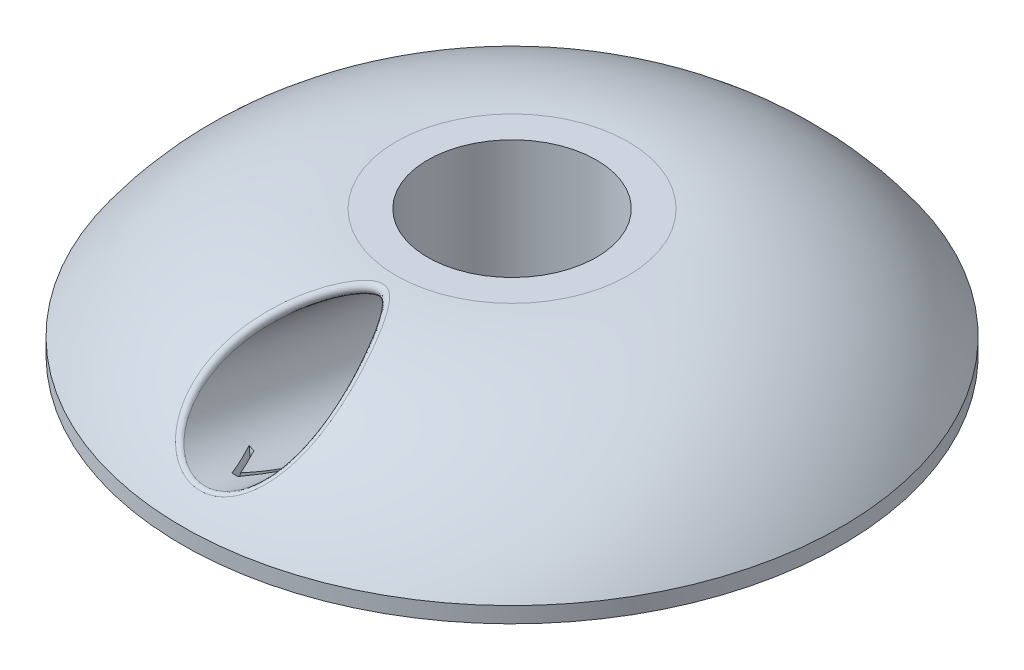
ISO-10303-21;
HEADER;
FILE_DESCRIPTION(('STEP AP214'),'2;1');
FILE_NAME('part.step','',(''),(''),'','','');
FILE_SCHEMA(('AUTOMOTIVE_DESIGN { 1 0 10303 214 1 1 1 1 }'));
ENDSEC;
DATA;
#1=APPLICATION_CONTEXT('core data for automotive mechanical design processes');
#2=APPLICATION_PROTOCOL_DEFINITION('international standard','automotive_design',2000,#1);
#3=PRODUCT_CONTEXT('',#1,'mechanical');
#4=PRODUCT('Part','Part','',(#3));
#5=PRODUCT_RELATED_PRODUCT_CATEGORY('part','',(#4));
#6=PRODUCT_DEFINITION_FORMATION('','',#4);
#7=PRODUCT_DEFINITION_CONTEXT('part definition',#1,'design');
#8=PRODUCT_DEFINITION('design','',#6,#7);
#9=PRODUCT_DEFINITION_SHAPE('','',#8);
#10=(LENGTH_UNIT() NAMED_UNIT(*) SI_UNIT(.MILLI.,.METRE.));
#11=(NAMED_UNIT(*) PLANE_ANGLE_UNIT() SI_UNIT($,.RADIAN.));
#12=(NAMED_UNIT(*) SI_UNIT($,.STERADIAN.) SOLID_ANGLE_UNIT());
#13=UNCERTAINTY_MEASURE_WITH_UNIT(LENGTH_MEASURE(1.E-05),#10,'distance_accuracy_value','');
#14=(GEOMETRIC_REPRESENTATION_CONTEXT(3) GLOBAL_UNCERTAINTY_ASSIGNED_CONTEXT((#13)) GLOBAL_UNIT_ASSIGNED_CONTEXT((#10,
#11,#12)) REPRESENTATION_CONTEXT('',''));
#15=CARTESIAN_POINT('',(0.,0.,0.));
#16=DIRECTION('',(0.,0.,1.));
#17=DIRECTION('',(1.,0.,0.));
#18=AXIS2_PLACEMENT_3D('',#15,#16,#17);
#19=CARTESIAN_POINT('',(0.,0.,0.));
#20=DIRECTION('',(0.,-1.,0.));
#21=DIRECTION('',(0.,0.,-1.));
#22=AXIS2_PLACEMENT_3D('',#19,#20,#21);
#23=CYLINDRICAL_SURFACE('',#22,8.);
#24=CARTESIAN_POINT('',(0.,12.,0.));
#25=DIRECTION('',(0.,-1.,0.));
#26=DIRECTION('',(0.,0.,-1.));
#27=AXIS2_PLACEMENT_3D('',#24,#25,#26);
#28=CIRCLE('',#27,8.);
#29=CARTESIAN_POINT('',(0.,12.,-8.));
#30=VERTEX_POINT('',#29);
#31=EDGE_CURVE('E243',#30,#30,#28,.T.);
#32=ORIENTED_EDGE('',*,*,#31,.F.);
#33=EDGE_LOOP('',(#32));
#34=FACE_BOUND('',#33,.T.);
#35=CARTESIAN_POINT('',(0.,0.,0.));
#36=DIRECTION('',(0.,-1.,0.));
#37=DIRECTION('',(0.,0.,-1.));
#38=AXIS2_PLACEMENT_3D('',#35,#36,#37);
#39=CIRCLE('',#38,8.);
#40=CARTESIAN_POINT('',(0.,0.,-8.));
#41=VERTEX_POINT('',#40);
#42=EDGE_CURVE('E247',#41,#41,#39,.T.);
#43=ORIENTED_EDGE('',*,*,#42,.T.);
#44=EDGE_LOOP('',(#43));
#45=FACE_BOUND('',#44,.T.);
#46=CARTESIAN_POINT('',(0.,10.2127009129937,8.));
#47=CARTESIAN_POINT('',(-0.120131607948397,10.2127002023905,7.9999994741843));
#48=CARTESIAN_POINT('',(-0.240273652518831,10.2078187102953,7.99728721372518));
#49=CARTESIAN_POINT('',(-0.47957953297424,10.1883830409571,7.98651118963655));
#50=CARTESIAN_POINT('',(-0.598742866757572,10.1738241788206,7.97844483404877));
#51=CARTESIAN_POINT('',(-0.835242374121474,10.1352799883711,7.95716580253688));
#52=CARTESIAN_POINT('',(-0.952575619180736,10.1112808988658,7.94394561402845));
#53=CARTESIAN_POINT('',(-1.18442463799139,10.054273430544,7.91270062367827));
#54=CARTESIAN_POINT('',(-1.29893907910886,10.0212608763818,7.89467359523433));
#55=CARTESIAN_POINT('',(-1.52356013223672,9.94703368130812,7.85440570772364));
#56=CARTESIAN_POINT('',(-1.63369265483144,9.90588015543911,7.83219630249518));
#57=CARTESIAN_POINT('',(-1.84988638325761,9.81579461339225,7.78397086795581));
#58=CARTESIAN_POINT('',(-1.95594610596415,9.76685979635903,7.75795346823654));
#59=CARTESIAN_POINT('',(-2.26725415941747,9.60931575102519,7.67499969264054));
#60=CARTESIAN_POINT('',(-2.46579267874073,9.48991239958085,7.61313159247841));
#61=CARTESIAN_POINT('',(-2.90908938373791,9.1804744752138,7.45722330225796));
#62=CARTESIAN_POINT('',(-3.14553898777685,8.98036913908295,7.35952158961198));
#63=CARTESIAN_POINT('',(-3.47103072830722,8.65349604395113,7.20876893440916));
#64=CARTESIAN_POINT('',(-3.57479328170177,8.53990176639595,7.15774103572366));
#65=CARTESIAN_POINT('',(-3.77247901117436,8.30446359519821,7.05554816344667));
#66=CARTESIAN_POINT('',(-3.86640301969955,8.18262040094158,7.00438320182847));
#67=CARTESIAN_POINT('',(-4.0453227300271,7.92974063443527,6.90261494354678));
#68=CARTESIAN_POINT('',(-4.13019019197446,7.79860711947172,6.85202698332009));
#69=CARTESIAN_POINT('',(-4.2893077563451,7.52912328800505,6.75356209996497));
#70=CARTESIAN_POINT('',(-4.36355656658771,7.39077209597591,6.70568550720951));
#71=CARTESIAN_POINT('',(-4.56952620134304,6.96599839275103,6.56860353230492));
#72=CARTESIAN_POINT('',(-4.68494685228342,6.66918314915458,6.48566107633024));
#73=CARTESIAN_POINT('',(-4.84293612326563,6.1313928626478,6.36813874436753));
#74=CARTESIAN_POINT('',(-4.89653429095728,5.89519829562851,6.32663844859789));
#75=CARTESIAN_POINT('',(-4.95329434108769,5.53515521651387,6.28214993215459));
#76=CARTESIAN_POINT('',(-4.96827424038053,5.41420512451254,6.27028129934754));
#77=CARTESIAN_POINT('',(-4.98994735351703,5.17112562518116,6.2530498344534));
#78=CARTESIAN_POINT('',(-4.9966440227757,5.04899673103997,6.24768428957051));
#79=CARTESIAN_POINT('',(-5.00141452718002,4.80358733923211,6.2438658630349));
#80=CARTESIAN_POINT('',(-4.99942689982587,4.68030481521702,6.24546225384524));
#81=CARTESIAN_POINT('',(-4.98645404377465,4.43451084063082,6.25582495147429));
#82=CARTESIAN_POINT('',(-4.97546885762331,4.31199938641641,6.2645912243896));
#83=CARTESIAN_POINT('',(-4.94443106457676,4.06881082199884,6.28911681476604));
#84=CARTESIAN_POINT('',(-4.92437623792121,3.94813416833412,6.30487784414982));
#85=CARTESIAN_POINT('',(-4.87530955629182,3.70966940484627,6.34289501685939));
#86=CARTESIAN_POINT('',(-4.84629793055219,3.59188122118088,6.36515099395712));
#87=CARTESIAN_POINT('',(-4.78269861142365,3.37091247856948,6.41305083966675));
#88=CARTESIAN_POINT('',(-4.74888619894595,3.26739603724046,6.43818317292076));
#89=CARTESIAN_POINT('',(-4.67437753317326,3.06394702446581,6.49248195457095));
#90=CARTESIAN_POINT('',(-4.63367900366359,2.96401565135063,6.52164973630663));
#91=CARTESIAN_POINT('',(-4.50169512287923,2.67025456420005,6.61409547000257));
#92=CARTESIAN_POINT('',(-4.40048910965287,2.48234651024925,6.68234126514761));
#93=CARTESIAN_POINT('',(-4.1607434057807,2.10343793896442,6.83452023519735));
#94=CARTESIAN_POINT('',(-4.01919477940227,1.91472852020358,6.91935380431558));
#95=CARTESIAN_POINT('',(-3.70909053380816,1.56142713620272,7.09041443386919));
#96=CARTESIAN_POINT('',(-3.54051694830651,1.39685135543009,7.17664238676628));
#97=CARTESIAN_POINT('',(-3.25560613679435,1.15756741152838,7.30851048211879));
#98=CARTESIAN_POINT('',(-3.14720650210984,1.07422224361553,7.35593677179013));
#99=CARTESIAN_POINT('',(-2.92293415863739,0.916491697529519,7.4478935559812));
#100=CARTESIAN_POINT('',(-2.80706376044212,0.842103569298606,7.49242493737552));
#101=CARTESIAN_POINT('',(-2.56840148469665,0.702621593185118,7.5775575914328));
#102=CARTESIAN_POINT('',(-2.44560617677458,0.637532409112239,7.6181568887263));
#103=CARTESIAN_POINT('',(-2.19390877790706,0.517127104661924,7.69441640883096));
#104=CARTESIAN_POINT('',(-2.06500956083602,0.461806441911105,7.73007892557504));
#105=CARTESIAN_POINT('',(-1.80203736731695,0.361388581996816,7.79557558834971));
#106=CARTESIAN_POINT('',(-1.66797082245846,0.316279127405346,7.82541671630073));
#107=CARTESIAN_POINT('',(-1.39553240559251,0.236622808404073,7.87856201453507));
#108=CARTESIAN_POINT('',(-1.25716248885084,0.202071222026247,7.90186910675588));
#109=CARTESIAN_POINT('',(-0.977195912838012,0.143867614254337,7.94135160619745));
#110=CARTESIAN_POINT('',(-0.835600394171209,0.120211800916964,7.95752949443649));
#111=CARTESIAN_POINT('',(-0.550342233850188,0.0840499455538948,7.98233132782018));
#112=CARTESIAN_POINT('',(-0.406679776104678,0.0715429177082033,7.99095594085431));
#113=CARTESIAN_POINT('',(-0.131066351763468,0.0584179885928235,8.00000975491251));
#114=CARTESIAN_POINT('',(0.000819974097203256,0.0568632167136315,8.00108473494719));
#115=CARTESIAN_POINT('',(0.264304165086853,0.0631884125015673,7.99671852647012));
#116=CARTESIAN_POINT('',(0.395901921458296,0.0710714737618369,7.99127520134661));
#117=CARTESIAN_POINT('',(0.657713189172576,0.0961933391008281,7.97399633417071));
#118=CARTESIAN_POINT('',(0.787927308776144,0.11342784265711,7.96216373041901));
#119=CARTESIAN_POINT('',(1.04613926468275,0.157090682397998,7.93236991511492));
#120=CARTESIAN_POINT('',(1.17413624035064,0.183522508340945,7.91440637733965));
#121=CARTESIAN_POINT('',(1.4240553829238,0.244625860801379,7.87322832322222));
#122=CARTESIAN_POINT('',(1.54604959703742,0.279091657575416,7.85014551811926));
#123=CARTESIAN_POINT('',(1.78633002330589,0.356299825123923,7.79898372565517));
#124=CARTESIAN_POINT('',(1.90461489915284,0.399045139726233,7.77090296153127));
#125=CARTESIAN_POINT('',(2.25282899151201,0.53925774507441,7.67998220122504));
#126=CARTESIAN_POINT('',(2.4763189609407,0.648751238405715,7.61042927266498));
#127=CARTESIAN_POINT('',(2.91600562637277,0.905831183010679,7.45353749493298));
#128=CARTESIAN_POINT('',(3.1306354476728,1.05552451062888,7.36530264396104));
#129=CARTESIAN_POINT('',(3.53120318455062,1.38651137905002,7.18185879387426));
#130=CARTESIAN_POINT('',(3.7171085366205,1.56784029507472,7.08664205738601));
#131=CARTESIAN_POINT('',(3.97732557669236,1.86878181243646,6.94202896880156));
#132=CARTESIAN_POINT('',(4.06341934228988,1.97803916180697,6.89185267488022));
#133=CARTESIAN_POINT('',(4.22553980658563,2.20466380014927,6.79365631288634));
#134=CARTESIAN_POINT('',(4.30157131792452,2.32202717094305,6.74563522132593));
#135=CARTESIAN_POINT('',(4.44281978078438,2.56430523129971,6.65345520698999));
#136=CARTESIAN_POINT('',(4.50805071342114,2.6892098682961,6.60929132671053));
#137=CARTESIAN_POINT('',(4.62710022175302,2.9460840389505,6.52650013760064));
#138=CARTESIAN_POINT('',(4.68092294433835,3.07805098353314,6.48787081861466));
#139=CARTESIAN_POINT('',(4.76531126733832,3.31655357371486,6.42603061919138));
#140=CARTESIAN_POINT('',(4.79837253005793,3.42182577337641,6.40132616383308));
#141=CARTESIAN_POINT('',(4.85713922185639,3.63541471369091,6.35685132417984));
#142=CARTESIAN_POINT('',(4.88284610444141,3.7437308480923,6.33707996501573));
#143=CARTESIAN_POINT('',(4.92669962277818,3.96263143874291,6.30304711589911));
#144=CARTESIAN_POINT('',(4.94485317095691,4.07321372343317,6.28878058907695));
#145=CARTESIAN_POINT('',(4.9735543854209,4.29595932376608,6.26610656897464));
#146=CARTESIAN_POINT('',(4.98410180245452,4.40812269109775,6.25769926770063));
#147=CARTESIAN_POINT('',(4.9976251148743,4.63310076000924,6.24690499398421));
#148=CARTESIAN_POINT('',(5.00060721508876,4.74591485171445,6.24451308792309));
#149=CARTESIAN_POINT('',(4.99918702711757,4.97148033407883,6.24564764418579));
#150=CARTESIAN_POINT('',(4.9947823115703,5.08423169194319,6.24917605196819));
#151=CARTESIAN_POINT('',(4.97084517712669,5.42135562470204,6.26827089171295));
#152=CARTESIAN_POINT('',(4.94058765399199,5.644559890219,6.2923486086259));
#153=CARTESIAN_POINT('',(4.84091899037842,6.15008432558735,6.369498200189));
#154=CARTESIAN_POINT('',(4.76235175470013,6.42956285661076,6.42919346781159));
#155=CARTESIAN_POINT('',(4.61574781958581,6.83388585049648,6.53440622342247));
#156=CARTESIAN_POINT('',(4.56200296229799,6.96633292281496,6.57214543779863));
#157=CARTESIAN_POINT('',(4.4453744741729,7.22591327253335,6.65158897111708));
#158=CARTESIAN_POINT('',(4.382491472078,7.35304691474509,6.69329301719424));
#159=CARTESIAN_POINT('',(4.17810449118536,7.73075293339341,6.82421540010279));
#160=CARTESIAN_POINT('',(4.02274733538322,7.97246861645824,6.91781792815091));
#161=CARTESIAN_POINT('',(3.67771438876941,8.42873709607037,7.10726279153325));
#162=CARTESIAN_POINT('',(3.48805522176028,8.64330296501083,7.20310402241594));
#163=CARTESIAN_POINT('',(3.08610311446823,9.03022098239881,7.38389654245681));
#164=CARTESIAN_POINT('',(2.87553068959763,9.20420233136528,7.46915557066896));
#165=CARTESIAN_POINT('',(2.42572588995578,9.51757349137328,7.62709160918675));
#166=CARTESIAN_POINT('',(2.18651799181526,9.65699253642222,7.69977923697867));
#167=CARTESIAN_POINT('',(1.72751901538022,9.8727192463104,7.81416512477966));
#168=CARTESIAN_POINT('',(1.51177329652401,9.95582722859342,7.85907030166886));
#169=CARTESIAN_POINT('',(1.17898134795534,10.0556573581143,7.91344951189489));
#170=CARTESIAN_POINT('',(1.06660044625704,10.0847841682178,7.92940644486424));
#171=CARTESIAN_POINT('',(0.839406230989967,10.1343767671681,7.95666099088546));
#172=CARTESIAN_POINT('',(0.724594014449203,10.1548463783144,7.96796066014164));
#173=CARTESIAN_POINT('',(0.508317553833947,10.1847082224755,7.98447335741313));
#174=CARTESIAN_POINT('',(0.407047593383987,10.1951907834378,7.99028460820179));
#175=CARTESIAN_POINT('',(0.203854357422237,10.2091882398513,7.99804860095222));
#176=CARTESIAN_POINT('',(0.101930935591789,10.2127015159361,8.0000004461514));
#177=CARTESIAN_POINT('',(0.,10.2127009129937,8.));
#178=B_SPLINE_CURVE_WITH_KNOTS('',3,(#46,#47,#48,#49,#50,#51,#52,#53,#54,#55,#56,#57,#58,#59,
#60,#61,#62,#63,#64,#65,#66,#67,#68,#69,#70,#71,#72,#73,#74,#75,#76,#77,#78,#79,#80,#81,#82,#83,
#84,#85,#86,#87,#88,#89,#90,#91,#92,#93,#94,#95,#96,#97,#98,#99,#100,#101,#102,#103,#104,#105,
#106,#107,#108,#109,#110,#111,#112,#113,#114,#115,#116,#117,#118,#119,#120,#121,#122,#123,#124,
#125,#126,#127,#128,#129,#130,#131,#132,#133,#134,#135,#136,#137,#138,#139,#140,#141,#142,#143,
#144,#145,#146,#147,#148,#149,#150,#151,#152,#153,#154,#155,#156,#157,#158,#159,#160,#161,#162,
#163,#164,#165,#166,#167,#168,#169,#170,#171,#172,#173,#174,#175,#176,#177),.UNSPECIFIED.,.T.,
.F.,(4,2,2,2,2,2,2,2,2,2,2,2,2,2,2,2,2,2,2,2,2,2,2,2,2,2,2,2,2,2,2,2,2,2,2,2,2,2,2,2,2,2,2,2,2,
2,2,2,2,2,2,2,2,2,2,2,2,2,2,2,2,2,2,2,2,4),(0.,0.360284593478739,0.720743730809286,
1.08173027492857,1.44288432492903,1.8014235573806,2.16009213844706,2.87691631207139,
3.84589537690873,4.33179508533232,4.81765364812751,5.3096697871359,5.80174574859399,
6.7833099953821,7.51748601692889,7.88443888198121,8.25123861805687,8.62063854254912,
8.99003672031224,9.35952535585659,9.72900453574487,10.0639276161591,10.3989616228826,
11.0686771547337,11.8180588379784,12.567940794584,13.001696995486,13.4353196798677,
13.8691590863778,14.302796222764,14.7359100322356,15.1688298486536,15.6015988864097,
16.0343296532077,16.429538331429,16.8248765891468,17.2200331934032,17.615339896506,
18.0014612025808,18.3877200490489,19.1596144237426,19.9847614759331,20.8108371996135,
21.2539843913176,21.69691885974,22.1392753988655,22.5814708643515,22.9203340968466,
23.2591303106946,23.5976157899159,23.9361123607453,24.2743312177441,24.6126612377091,
25.2894346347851,26.1735724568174,26.6167436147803,27.0598842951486,27.9630261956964,
28.8657315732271,29.7208436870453,30.5752300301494,31.2785472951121,31.629733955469,
31.9807653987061,32.2863936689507,32.5920929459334),.UNSPECIFIED.);
#179=CARTESIAN_POINT('',(0.,10.2127009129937,8.));
#180=VERTEX_POINT('',#179);
#181=EDGE_CURVE('E137',#180,#180,#178,.T.);
#182=ORIENTED_EDGE('',*,*,#181,.T.);
#183=EDGE_LOOP('',(#182));
#184=FACE_BOUND('',#183,.T.);
#185=ADVANCED_FACE('F32',(#34,#45,#184),#23,.F.);
#186=CARTESIAN_POINT('',(0.,-12.7767857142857,0.));
#187=DIRECTION('',(0.,-1.,0.));
#188=DIRECTION('',(0.,0.,-1.));
#189=AXIS2_PLACEMENT_3D('',#186,#187,#188);
#190=DEGENERATE_TOROIDAL_SURFACE('',#189,11.,24.7767857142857,.T.);
#191=CARTESIAN_POINT('',(2.1879749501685,10.8132610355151,14.3091668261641));
#192=CARTESIAN_POINT('',(1.91662367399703,10.984354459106,14.5190000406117));
#193=CARTESIAN_POINT('',(2.00815216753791,11.3565721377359,14.5156853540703));
#194=CARTESIAN_POINT('',(2.09968066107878,11.7287898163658,14.5123706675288));
#195=CARTESIAN_POINT('',(2.41856338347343,11.750991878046,14.300816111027));
#196=CARTESIAN_POINT('',(2.28146597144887,10.7938114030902,14.4608797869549));
#197=CARTESIAN_POINT('',(2.01324671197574,10.9693091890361,14.6644173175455));
#198=CARTESIAN_POINT('',(2.10855316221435,11.3368528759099,14.6632826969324));
#199=CARTESIAN_POINT('',(2.20314792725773,11.7045362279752,14.6611018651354));
#200=CARTESIAN_POINT('',(2.5223457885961,11.7265686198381,14.4566589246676));
#201=CARTESIAN_POINT('',(2.37197888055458,10.7725099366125,14.6144309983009));
#202=CARTESIAN_POINT('',(2.10776648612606,10.9520659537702,14.8129050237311));
#203=CARTESIAN_POINT('',(2.20630772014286,11.3150214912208,14.8134148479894));
#204=CARTESIAN_POINT('',(2.30420369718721,11.6781386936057,14.8128988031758));
#205=CARTESIAN_POINT('',(2.62288199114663,11.7000400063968,14.6144087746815));
#206=CARTESIAN_POINT('',(2.54794862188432,10.7261447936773,14.9241782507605));
#207=CARTESIAN_POINT('',(2.29228466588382,10.9132430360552,15.1134897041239));
#208=CARTESIAN_POINT('',(2.39707271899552,11.2671138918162,15.1172830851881));
#209=CARTESIAN_POINT('',(2.50122148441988,11.6211456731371,15.1200562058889));
#210=CARTESIAN_POINT('',(2.81843781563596,11.6427245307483,14.9326658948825));
#211=CARTESIAN_POINT('',(2.6334046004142,10.701080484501,15.0803747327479));
#212=CARTESIAN_POINT('',(2.38233877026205,10.8916861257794,15.2656058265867));
#213=CARTESIAN_POINT('',(2.49008235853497,11.2410369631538,15.2710197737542));
#214=CARTESIAN_POINT('',(2.5972447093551,11.5905694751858,15.2754370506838));
#215=CARTESIAN_POINT('',(2.91345650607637,11.6119369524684,15.0931736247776));
#216=CARTESIAN_POINT('',(2.8831747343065,10.6201341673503,15.552102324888));
#217=CARTESIAN_POINT('',(2.64552272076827,10.8207045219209,15.7246406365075));
#218=CARTESIAN_POINT('',(2.76269116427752,11.1563693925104,15.7363788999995));
#219=CARTESIAN_POINT('',(2.87753902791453,11.4927527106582,15.7441646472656));
#220=CARTESIAN_POINT('',(3.19130480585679,11.5130780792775,15.5779851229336));
#221=CARTESIAN_POINT('',(3.0407624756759,10.5585257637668,15.8705577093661));
#222=CARTESIAN_POINT('',(2.81351221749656,10.7646637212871,16.0371061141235));
#223=CARTESIAN_POINT('',(2.93573129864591,11.0913694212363,16.0519413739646));
#224=CARTESIAN_POINT('',(3.05600025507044,11.4189426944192,16.0630208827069));
#225=CARTESIAN_POINT('',(3.36678381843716,11.4385446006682,15.9053575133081));
#226=CARTESIAN_POINT('',(3.33965551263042,10.4199864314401,16.5113594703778));
#227=CARTESIAN_POINT('',(3.13339240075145,10.6353229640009,16.6674017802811));
#228=CARTESIAN_POINT('',(3.26520052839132,10.9443779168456,16.6884940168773));
#229=CARTESIAN_POINT('',(3.3950972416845,11.2542880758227,16.7058814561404));
#230=CARTESIAN_POINT('',(3.69986868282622,11.2722549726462,16.5642847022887));
#231=CARTESIAN_POINT('',(3.48098423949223,10.3430779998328,16.8336994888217));
#232=CARTESIAN_POINT('',(3.28560658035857,10.562201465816,16.9853868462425));
#233=CARTESIAN_POINT('',(3.42165350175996,10.8624113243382,17.009475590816));
#234=CARTESIAN_POINT('',(3.55608581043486,11.1636064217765,17.0300479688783));
#235=CARTESIAN_POINT('',(3.85750024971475,11.1805241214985,16.895832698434));
#236=CARTESIAN_POINT('',(3.74765353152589,10.1738993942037,17.4807955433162));
#237=CARTESIAN_POINT('',(3.5739072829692,10.3988428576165,17.6247116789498));
#238=CARTESIAN_POINT('',(3.71793043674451,10.6815355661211,17.6548639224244));
#239=CARTESIAN_POINT('',(3.86035874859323,10.965202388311,17.6815412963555));
#240=CARTESIAN_POINT('',(4.15514255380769,10.9798215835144,17.5616039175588));
#241=CARTESIAN_POINT('',(3.87299916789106,10.0816341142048,17.8055507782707));
#242=CARTESIAN_POINT('',(3.71025867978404,10.3087452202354,17.9462073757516));
#243=CARTESIAN_POINT('',(3.85775967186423,10.5826317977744,17.9792695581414));
#244=CARTESIAN_POINT('',(4.00393019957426,10.8576080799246,18.0090298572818));
#245=CARTESIAN_POINT('',(4.29515887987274,10.8708553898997,17.8958262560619));
#246=CARTESIAN_POINT('',(4.1291239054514,9.86288937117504,18.5179911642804));
#247=CARTESIAN_POINT('',(3.98981184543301,10.0931631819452,18.6515484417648));
#248=CARTESIAN_POINT('',(4.14464318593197,10.3476921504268,18.6917284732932));
#249=CARTESIAN_POINT('',(4.29761453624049,10.6037441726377,18.7272866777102));
#250=CARTESIAN_POINT('',(4.5814641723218,10.6135192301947,18.6292499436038));
#251=CARTESIAN_POINT('',(4.25641680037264,9.73323986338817,18.9059185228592));
#252=CARTESIAN_POINT('',(4.1300856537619,9.96414350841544,19.0366786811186));
#253=CARTESIAN_POINT('',(4.28802936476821,10.2081715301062,19.0801728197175));
#254=CARTESIAN_POINT('',(4.44452536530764,10.4538879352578,19.1193225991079));
#255=CARTESIAN_POINT('',(4.72389748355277,10.4615959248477,19.0287413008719));
#256=CARTESIAN_POINT('',(4.48466996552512,9.45289980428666,19.6814824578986));
#257=CARTESIAN_POINT('',(4.3834002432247,9.6828790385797,19.8072553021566));
#258=CARTESIAN_POINT('',(4.54688861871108,9.90605460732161,19.8575141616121));
#259=CARTESIAN_POINT('',(4.70894660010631,10.1309008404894,19.9034746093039));
#260=CARTESIAN_POINT('',(4.9795494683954,10.1341973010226,19.8277075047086));
#261=CARTESIAN_POINT('',(4.58562024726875,9.30220130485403,20.0691188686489));
#262=CARTESIAN_POINT('',(4.49681300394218,9.53078937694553,20.1929495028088));
#263=CARTESIAN_POINT('',(4.66235110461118,9.74344958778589,20.2464112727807));
#264=CARTESIAN_POINT('',(4.82685563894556,9.95791204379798,20.2958454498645));
#265=CARTESIAN_POINT('',(5.09275706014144,9.95871308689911,20.2271822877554));
#266=CARTESIAN_POINT('',(4.75743043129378,8.98106098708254,20.8413629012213));
#267=CARTESIAN_POINT('',(4.69233282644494,9.20483581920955,20.9617677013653));
#268=CARTESIAN_POINT('',(4.86123330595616,9.39661259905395,21.0217581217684));
#269=CARTESIAN_POINT('',(5.02911548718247,9.59016544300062,21.0777769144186));
#270=CARTESIAN_POINT('',(5.28571425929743,9.58569333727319,21.0232942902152));
#271=CARTESIAN_POINT('',(4.82833325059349,8.81064777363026,21.2259740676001));
#272=CARTESIAN_POINT('',(4.77485812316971,9.03113383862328,21.345136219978));
#273=CARTESIAN_POINT('',(4.94469870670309,9.21241195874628,21.4082105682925));
#274=CARTESIAN_POINT('',(5.1139125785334,9.39555782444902,21.4675885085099));
#275=CARTESIAN_POINT('',(5.36551158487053,9.38818976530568,21.4199347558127));
#276=CARTESIAN_POINT('',(4.93581994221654,8.45171267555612,21.9900042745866));
#277=CARTESIAN_POINT('',(4.90407742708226,8.66377494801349,22.1070137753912));
#278=CARTESIAN_POINT('',(5.07500123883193,8.82419106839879,22.1763919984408));
#279=CARTESIAN_POINT('',(5.24530439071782,8.98645584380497,22.2421128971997));
#280=CARTESIAN_POINT('',(5.48689098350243,8.97299917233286,22.208140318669));
#281=CARTESIAN_POINT('',(4.97242733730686,8.26320330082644,22.3694266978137));
#282=CARTESIAN_POINT('',(4.95117119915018,8.47021880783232,22.4857835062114));
#283=CARTESIAN_POINT('',(5.12186347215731,8.62018450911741,22.5581240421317));
#284=CARTESIAN_POINT('',(5.29232356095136,8.77204997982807,22.6270923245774));
#285=CARTESIAN_POINT('',(5.52849924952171,8.75532609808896,22.5997087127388));
#286=CARTESIAN_POINT('',(5.01019781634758,7.82467124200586,23.2078533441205));
#287=CARTESIAN_POINT('',(5.01026378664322,8.01904871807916,23.3221590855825));
#288=CARTESIAN_POINT('',(5.1795115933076,8.14539173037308,23.4021295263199));
#289=CARTESIAN_POINT('',(5.34841597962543,8.27457843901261,23.4770390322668));
#290=CARTESIAN_POINT('',(5.57239631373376,8.24972204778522,23.4652768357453));
#291=CARTESIAN_POINT('',(5.0011365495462,7.57053916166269,23.6648415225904));
#292=CARTESIAN_POINT('',(5.01226355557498,7.75649805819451,23.7791452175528));
#293=CARTESIAN_POINT('',(5.17937136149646,7.87010958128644,23.8624851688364));
#294=CARTESIAN_POINT('',(5.34686368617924,7.98655217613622,23.9413453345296));
#295=CARTESIAN_POINT('',(5.56328890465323,7.95722546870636,23.9372662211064));
#296=CARTESIAN_POINT('',(4.91184494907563,7.04578988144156,24.5585780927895));
#297=CARTESIAN_POINT('',(4.94152122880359,7.212958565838,24.6729607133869));
#298=CARTESIAN_POINT('',(5.1029424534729,7.30148707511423,24.7633525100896));
#299=CARTESIAN_POINT('',(5.26473320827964,7.39279421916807,24.8493367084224));
#300=CARTESIAN_POINT('',(5.46568447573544,7.35412918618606,24.8607224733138));
#301=CARTESIAN_POINT('',(4.83171414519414,6.7751962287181,24.9953538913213));
#302=CARTESIAN_POINT('',(4.86958049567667,6.931934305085,25.1104107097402));
#303=CARTESIAN_POINT('',(5.02676025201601,7.00817250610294,25.2038910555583));
#304=CARTESIAN_POINT('',(5.18499906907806,7.08699668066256,25.2936538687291));
#305=CARTESIAN_POINT('',(5.37729848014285,7.04355536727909,25.3122171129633));
#306=CARTESIAN_POINT('',(4.61572046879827,6.29129017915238,25.7416708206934));
#307=CARTESIAN_POINT('',(4.66419329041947,6.42811175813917,25.8584766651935));
#308=CARTESIAN_POINT('',(4.8125634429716,6.4835181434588,25.9570347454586));
#309=CARTESIAN_POINT('',(4.96156275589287,6.54047180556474,26.053375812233));
#310=CARTESIAN_POINT('',(5.13809346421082,6.48875921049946,26.0839794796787));
#311=CARTESIAN_POINT('',(4.496620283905,6.07890587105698,26.0576011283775));
#312=CARTESIAN_POINT('',(4.5488956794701,6.20681706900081,26.1751673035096));
#313=CARTESIAN_POINT('',(4.69249201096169,6.25321072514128,26.2759939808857));
#314=CARTESIAN_POINT('',(4.83699896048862,6.300982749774,26.3749709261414));
#315=CARTESIAN_POINT('',(5.00598163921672,6.24546442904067,26.4107846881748));
#316=CARTESIAN_POINT('',(4.20289267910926,5.65956423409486,26.662731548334));
#317=CARTESIAN_POINT('',(4.26009802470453,5.76955028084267,26.7816606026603));
#318=CARTESIAN_POINT('',(4.39290808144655,5.79842877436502,26.8871492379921));
#319=CARTESIAN_POINT('',(4.52660798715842,5.82866206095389,26.9908146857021));
#320=CARTESIAN_POINT('',(4.67977752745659,5.76541732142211,27.0369159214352));
#321=CARTESIAN_POINT('',(4.02833335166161,5.45260058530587,26.9519638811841));
#322=CARTESIAN_POINT('',(4.08691490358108,5.55338682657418,27.0718687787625));
#323=CARTESIAN_POINT('',(4.21346846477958,5.57394745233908,27.1793775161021));
#324=CARTESIAN_POINT('',(4.3411121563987,5.59561720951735,27.285475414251));
#325=CARTESIAN_POINT('',(4.48576124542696,5.52865735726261,27.3362750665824));
#326=CARTESIAN_POINT('',(3.66547508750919,5.09992787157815,27.4326166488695));
#327=CARTESIAN_POINT('',(3.72381713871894,5.18472567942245,27.5542416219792));
#328=CARTESIAN_POINT('',(3.83822380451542,5.1913967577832,27.6651602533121));
#329=CARTESIAN_POINT('',(3.95328990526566,5.19874182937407,27.7752248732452));
#330=CARTESIAN_POINT('',(4.0822002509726,5.1254238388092,27.8338752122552));
#331=CARTESIAN_POINT('',(3.48896306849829,4.9508655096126,27.6314514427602));
#332=CARTESIAN_POINT('',(3.54653046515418,5.02881580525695,27.7538378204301));
#333=CARTESIAN_POINT('',(3.65503614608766,5.02969636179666,27.8661720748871));
#334=CARTESIAN_POINT('',(3.76424195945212,5.03110189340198,27.9778646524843));
#335=CARTESIAN_POINT('',(3.88581377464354,4.95506660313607,28.0397637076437));
#336=CARTESIAN_POINT('',(3.0997367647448,4.66980317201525,28.0003114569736));
#337=CARTESIAN_POINT('',(3.15412389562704,4.73482894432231,28.1239995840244));
#338=CARTESIAN_POINT('',(3.24991478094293,4.7247935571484,28.2391479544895));
#339=CARTESIAN_POINT('',(3.34639365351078,4.71527791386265,28.3536600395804));
#340=CARTESIAN_POINT('',(3.45262531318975,4.63395762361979,28.4217702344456));
#341=CARTESIAN_POINT('',(2.88706393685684,4.53778395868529,28.1703692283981));
#342=CARTESIAN_POINT('',(2.93906048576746,4.59658436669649,28.2948060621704));
#343=CARTESIAN_POINT('',(3.02802543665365,4.5815702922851,28.4111448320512));
#344=CARTESIAN_POINT('',(3.11765101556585,4.56691247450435,28.5270602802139));
#345=CARTESIAN_POINT('',(3.21586960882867,4.48318377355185,28.5979219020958));
#346=CARTESIAN_POINT('',(2.46446261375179,4.31786007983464,28.4501372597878));
#347=CARTESIAN_POINT('',(2.51062126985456,4.36628910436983,28.5757412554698));
#348=CARTESIAN_POINT('',(2.58627382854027,4.34297713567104,28.6941489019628));
#349=CARTESIAN_POINT('',(2.66239580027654,4.31991916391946,28.8122559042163));
#350=CARTESIAN_POINT('',(2.74531458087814,4.23207900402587,28.8877518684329));
#351=CARTESIAN_POINT('',(2.25952491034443,4.22627720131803,28.5651483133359));
#352=CARTESIAN_POINT('',(2.30250368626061,4.27032526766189,28.6912874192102));
#353=CARTESIAN_POINT('',(2.37175224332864,4.24361767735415,28.8105099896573));
#354=CARTESIAN_POINT('',(2.44140554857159,4.21706549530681,28.9295519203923));
#355=CARTESIAN_POINT('',(2.51708697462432,4.12753752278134,29.0069150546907));
#356=CARTESIAN_POINT('',(1.82892231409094,4.06569881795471,28.765246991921));
#357=CARTESIAN_POINT('',(1.86469633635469,4.1021132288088,28.8922348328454));
#358=CARTESIAN_POINT('',(1.92053390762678,4.06940229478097,29.0129781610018));
#359=CARTESIAN_POINT('',(1.97677333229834,4.03684737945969,29.1335401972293));
#360=CARTESIAN_POINT('',(2.03749216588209,3.94426514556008,29.2142542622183));
#361=CARTESIAN_POINT('',(1.60326527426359,3.99669480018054,28.850345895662));
#362=CARTESIAN_POINT('',(1.63493258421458,4.02976744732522,28.9777565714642));
#363=CARTESIAN_POINT('',(1.6838455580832,3.99453713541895,29.0990966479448));
#364=CARTESIAN_POINT('',(1.73305232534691,3.95937821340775,29.2203547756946));
#365=CARTESIAN_POINT('',(1.7861337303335,3.86552452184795,29.3024419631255));
#366=CARTESIAN_POINT('',(1.13545225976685,3.88544766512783,28.9869097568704));
#367=CARTESIAN_POINT('',(1.15832359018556,3.91318565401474,29.1149273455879));
#368=CARTESIAN_POINT('',(1.19284461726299,3.87384017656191,29.2373051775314));
#369=CARTESIAN_POINT('',(1.22766392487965,3.8345688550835,29.3595982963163));
#370=CARTESIAN_POINT('',(1.26500071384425,3.73859120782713,29.4439694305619));
#371=CARTESIAN_POINT('',(0.893216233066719,3.84334626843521,29.0381966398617));
#372=CARTESIAN_POINT('',(0.911266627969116,3.86902773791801,29.1664812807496));
#373=CARTESIAN_POINT('',(0.938446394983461,3.82816213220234,29.289215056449));
#374=CARTESIAN_POINT('',(0.965772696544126,3.787312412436,29.4119306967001));
#375=CARTESIAN_POINT('',(0.995136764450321,3.69056029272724,29.497124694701));
#376=CARTESIAN_POINT('',(0.401066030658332,3.78965483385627,29.1035212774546));
#377=CARTESIAN_POINT('',(0.409287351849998,3.81274849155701,29.2321043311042));
#378=CARTESIAN_POINT('',(0.421436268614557,3.76990937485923,29.3553343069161));
#379=CARTESIAN_POINT('',(0.4337347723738,3.72708773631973,29.4785445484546));
#380=CARTESIAN_POINT('',(0.446837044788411,3.6293084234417,29.5648299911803));
#381=CARTESIAN_POINT('',(0.151154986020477,3.7780525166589,29.1175740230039));
#382=CARTESIAN_POINT('',(0.154208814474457,3.80057755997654,29.246231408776));
#383=CARTESIAN_POINT('',(0.1588277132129,3.75732133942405,29.3695588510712));
#384=CARTESIAN_POINT('',(0.163422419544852,3.71406641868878,29.4928848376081));
#385=CARTESIAN_POINT('',(0.168404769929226,3.61607345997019,29.5793955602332));
#386=CARTESIAN_POINT('',(-0.324113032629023,3.78583871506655,29.1081210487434));
#387=CARTESIAN_POINT('',(-0.330696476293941,3.80873872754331,29.2367358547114));
#388=CARTESIAN_POINT('',(-0.340566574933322,3.7657690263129,29.3599906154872));
#389=CARTESIAN_POINT('',(-0.350454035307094,3.722798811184,29.483245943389));
#390=CARTESIAN_POINT('',(-0.36110092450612,3.62495569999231,29.5695978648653));
#391=CARTESIAN_POINT('',(-0.549586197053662,3.80243775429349,29.0879960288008));
#392=CARTESIAN_POINT('',(-0.560793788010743,3.82614935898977,29.2165063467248));
#393=CARTESIAN_POINT('',(-0.577476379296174,3.78377828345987,29.3396198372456));
#394=CARTESIAN_POINT('',(-0.594303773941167,3.74142683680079,29.4627110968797));
#395=CARTESIAN_POINT('',(-0.612304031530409,3.6438908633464,29.5487386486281));
#396=CARTESIAN_POINT('',(-0.993032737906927,3.86031466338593,29.0175068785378));
#397=CARTESIAN_POINT('',(-1.01303726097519,3.88681480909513,29.1456955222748));
#398=CARTESIAN_POINT('',(-1.04327406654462,3.84657202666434,29.2682742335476));
#399=CARTESIAN_POINT('',(-1.07365418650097,3.80634845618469,29.3908310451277));
#400=CARTESIAN_POINT('',(-1.10633766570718,3.70991883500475,29.4756814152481));
#401=CARTESIAN_POINT('',(-1.21100676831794,3.90159037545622,28.9671453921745));
#402=CARTESIAN_POINT('',(-1.2352997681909,3.9300995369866,29.0950791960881));
#403=CARTESIAN_POINT('',(-1.27216264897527,3.8913541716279,29.2173020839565));
#404=CARTESIAN_POINT('',(-1.30927822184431,3.85267406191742,29.3394503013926));
#405=CARTESIAN_POINT('',(-1.3491689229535,3.75700918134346,29.4234861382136));
#406=CARTESIAN_POINT('',(-1.63398479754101,4.00634315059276,28.838436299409));
#407=CARTESIAN_POINT('',(-1.66618040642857,4.03987351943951,28.965799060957));
#408=CARTESIAN_POINT('',(-1.71606402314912,4.00500499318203,29.08704450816));
#409=CARTESIAN_POINT('',(-1.76619979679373,3.97020046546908,29.208216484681));
#410=CARTESIAN_POINT('',(-1.82035174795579,3.8765344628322,29.2901002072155));
#411=CARTESIAN_POINT('',(-1.83898311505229,4.06982986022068,28.7600765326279));
#412=CARTESIAN_POINT('',(-1.87488518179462,4.10642686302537,28.8870586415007));
#413=CARTESIAN_POINT('',(-1.93107073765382,4.07388413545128,29.0077467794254));
#414=CARTESIAN_POINT('',(-1.9875894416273,4.04146992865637,29.1282856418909));
#415=CARTESIAN_POINT('',(-2.04869697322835,3.9489804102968,29.2088969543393));
#416=CARTESIAN_POINT('',(-2.23186047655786,4.21559749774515,28.5784780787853));
#417=CARTESIAN_POINT('',(-2.27434908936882,4.25912511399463,28.7046892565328));
#418=CARTESIAN_POINT('',(-2.34276874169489,4.23203103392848,28.8239973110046));
#419=CARTESIAN_POINT('',(-2.41152303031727,4.20506495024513,28.9431565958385));
#420=CARTESIAN_POINT('',(-2.486275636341,4.11534811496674,29.0207269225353));
#421=CARTESIAN_POINT('',(-2.41973465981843,4.29788373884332,28.4752323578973));
#422=CARTESIAN_POINT('',(-2.46516590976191,4.34534256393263,28.6009708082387));
#423=CARTESIAN_POINT('',(-2.53945483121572,4.32130455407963,28.7195384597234));
#424=CARTESIAN_POINT('',(-2.61412857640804,4.29746835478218,28.8378675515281));
#425=CARTESIAN_POINT('',(-2.69550364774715,4.2092759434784,28.9137528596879));
#426=CARTESIAN_POINT('',(-2.79447584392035,4.48695496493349,28.2352814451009));
#427=CARTESIAN_POINT('',(-2.84518346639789,4.54332206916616,28.3600373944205));
#428=CARTESIAN_POINT('',(-2.93129298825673,4.52642680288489,28.476804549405));
#429=CARTESIAN_POINT('',(-3.01787165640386,4.50977672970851,28.5932812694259));
#430=CARTESIAN_POINT('',(-3.11278135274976,4.42514382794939,28.6651660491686));
#431=CARTESIAN_POINT('',(-2.97916578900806,4.5954051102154,28.096201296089));
#432=CARTESIAN_POINT('',(-3.03210673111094,4.6568842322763,28.2203590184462));
#433=CARTESIAN_POINT('',(-3.12411553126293,4.64408168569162,28.336130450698));
#434=CARTESIAN_POINT('',(-3.21661771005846,4.63162433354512,28.4514828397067));
#435=CARTESIAN_POINT('',(-3.31840059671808,4.54898961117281,28.5210956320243));
#436=CARTESIAN_POINT('',(-3.32287658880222,4.82578362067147,27.7962972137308));
#437=CARTESIAN_POINT('',(-3.37914080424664,4.89791399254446,27.9193642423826));
#438=CARTESIAN_POINT('',(-3.48229002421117,4.89400592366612,28.0328482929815));
#439=CARTESIAN_POINT('',(-3.58593774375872,4.89044476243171,28.1459115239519));
#440=CARTESIAN_POINT('',(-3.70098259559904,4.81215059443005,28.2104776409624));
#441=CARTESIAN_POINT('',(-3.4818838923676,4.9477190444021,27.6354618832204));
#442=CARTESIAN_POINT('',(-3.53924007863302,5.02548112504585,27.7579094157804));
#443=CARTESIAN_POINT('',(-3.6476274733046,5.02628293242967,27.8702287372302));
#444=CARTESIAN_POINT('',(-3.75650064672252,5.027525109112,27.9819980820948));
#445=CARTESIAN_POINT('',(-3.87793022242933,4.95147389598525,28.0439182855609));
#446=CARTESIAN_POINT('',(-3.80641237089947,5.22871964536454,27.2584325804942));
#447=CARTESIAN_POINT('',(-3.86507032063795,5.3193040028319,27.3795328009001));
#448=CARTESIAN_POINT('',(-3.9841984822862,5.33110249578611,27.4891001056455));
#449=CARTESIAN_POINT('',(-4.10405102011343,5.34355651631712,27.5978469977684));
#450=CARTESIAN_POINT('',(-4.23897292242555,5.27265633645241,27.6535362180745));
#451=CARTESIAN_POINT('',(-3.96557199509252,5.39002581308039,27.0378683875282));
#452=CARTESIAN_POINT('',(-4.02400103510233,5.48787909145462,27.15820477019));
#453=CARTESIAN_POINT('',(-4.14862291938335,5.50607316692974,27.2661907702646));
#454=CARTESIAN_POINT('',(-4.27388990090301,5.52506706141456,27.373133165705));
#455=CARTESIAN_POINT('',(-4.41596623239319,5.45710071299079,27.4252022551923));
#456=CARTESIAN_POINT('',(-4.24690189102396,5.71973315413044,26.5761486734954));
#457=CARTESIAN_POINT('',(-4.30334522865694,5.83203207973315,26.695264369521));
#458=CARTESIAN_POINT('',(-4.43787038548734,5.86368313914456,26.799701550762));
#459=CARTESIAN_POINT('',(-4.57304980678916,5.89614082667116,26.9030867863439));
#460=CARTESIAN_POINT('',(-4.72866147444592,5.83429226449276,26.9473259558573));
#461=CARTESIAN_POINT('',(-4.36901492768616,5.88814485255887,26.3349620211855));
#462=CARTESIAN_POINT('',(-4.42359415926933,6.00773755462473,26.453414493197));
#463=CARTESIAN_POINT('',(-4.56263215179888,6.04633381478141,26.5560904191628));
#464=CARTESIAN_POINT('',(-4.70219904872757,6.08584464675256,26.6575129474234));
#465=CARTESIAN_POINT('',(-4.86429951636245,6.02705176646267,26.6977515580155));
#466=CARTESIAN_POINT('',(-4.54626719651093,6.17451776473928,25.9138305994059));
#467=CARTESIAN_POINT('',(-4.59641252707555,6.30591390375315,26.0317720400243));
#468=CARTESIAN_POINT('',(-4.74230040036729,6.35688648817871,26.1308639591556));
#469=CARTESIAN_POINT('',(-4.88844428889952,6.40830133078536,26.2293510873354));
#470=CARTESIAN_POINT('',(-5.06102565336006,6.35501865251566,26.2620795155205));
#471=CARTESIAN_POINT('',(-4.61045198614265,6.29205289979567,25.7378846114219));
#472=CARTESIAN_POINT('',(-4.65845895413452,6.42831812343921,25.8554897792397));
#473=CARTESIAN_POINT('',(-4.80688839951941,6.48433643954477,25.9532450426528));
#474=CARTESIAN_POINT('',(-4.95552502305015,6.54082229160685,26.0503356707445));
#475=CARTESIAN_POINT('',(-5.13220988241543,6.48967921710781,26.0800873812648));
#476=CARTESIAN_POINT('',(-4.7231360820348,6.52649845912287,25.3800321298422));
#477=CARTESIAN_POINT('',(-4.76625798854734,6.67227146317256,25.4971052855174));
#478=CARTESIAN_POINT('',(-4.91928009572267,6.73853632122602,25.5920747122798));
#479=CARTESIAN_POINT('',(-5.07250957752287,6.80527125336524,25.6863766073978));
#480=CARTESIAN_POINT('',(-5.25707344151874,6.75840496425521,25.7100009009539));
#481=CARTESIAN_POINT('',(-4.77165081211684,6.64340938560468,25.1981316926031));
#482=CARTESIAN_POINT('',(-4.81197752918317,6.79384329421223,25.3149505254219));
#483=CARTESIAN_POINT('',(-4.9671003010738,6.86528681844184,25.4085293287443));
#484=CARTESIAN_POINT('',(-5.12237888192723,6.93722477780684,25.501379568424));
#485=CARTESIAN_POINT('',(-5.31076998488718,6.89247060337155,25.5219127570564));
#486=CARTESIAN_POINT('',(-4.89538363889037,6.99199280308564,24.644337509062));
#487=CARTESIAN_POINT('',(-4.92670670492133,7.15668798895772,24.7595430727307));
#488=CARTESIAN_POINT('',(-5.08720594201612,7.24316724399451,24.8498652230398));
#489=CARTESIAN_POINT('',(-5.2483331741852,7.33161381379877,24.9372739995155));
#490=CARTESIAN_POINT('',(-5.44751984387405,7.29240238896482,24.9493810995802));
#491=CARTESIAN_POINT('',(-4.94866661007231,7.22130629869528,24.2646569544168));
#492=CARTESIAN_POINT('',(-4.97239920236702,7.39454685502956,24.3794932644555));
#493=CARTESIAN_POINT('',(-5.1360111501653,7.49169875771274,24.467027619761));
#494=CARTESIAN_POINT('',(-5.29980775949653,7.59091071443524,24.5512301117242));
#495=CARTESIAN_POINT('',(-5.50609605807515,7.55576336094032,24.556987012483));
#496=CARTESIAN_POINT('',(-4.99746301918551,7.6112530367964,23.5878905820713));
#497=CARTESIAN_POINT('',(-5.00648566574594,7.79767065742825,23.7035634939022));
#498=CARTESIAN_POINT('',(-5.17386296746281,7.91419621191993,23.7850091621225));
#499=CARTESIAN_POINT('',(-5.34134664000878,8.03190991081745,23.864541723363));
#500=CARTESIAN_POINT('',(-5.55902647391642,8.00415086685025,23.8578178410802));
#501=CARTESIAN_POINT('',(-5.00401409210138,7.77483262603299,23.2936324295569));
#502=CARTESIAN_POINT('',(-5.00607519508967,7.96666246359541,23.4094205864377));
#503=CARTESIAN_POINT('',(-5.1747142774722,8.09138747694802,23.4885865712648));
#504=CARTESIAN_POINT('',(-5.34326444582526,8.21730219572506,23.5656853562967));
#505=CARTESIAN_POINT('',(-5.56569149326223,8.19242671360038,23.5539010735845));
#506=CARTESIAN_POINT('',(-4.99139232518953,8.09262832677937,22.6994030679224));
#507=CARTESIAN_POINT('',(-4.97875327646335,8.29432973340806,22.8158747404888));
#508=CARTESIAN_POINT('',(-5.14891577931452,8.43552328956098,22.8902527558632));
#509=CARTESIAN_POINT('',(-5.318988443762,8.57791155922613,22.9625522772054));
#510=CARTESIAN_POINT('',(-5.55034394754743,8.55859497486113,22.9403393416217));
#511=CARTESIAN_POINT('',(-4.97221080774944,8.24684126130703,22.3994299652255));
#512=CARTESIAN_POINT('',(-4.95164284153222,8.45298972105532,22.5163245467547));
#513=CARTESIAN_POINT('',(-5.12225669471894,8.60246436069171,22.5883397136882));
#514=CARTESIAN_POINT('',(-5.29258441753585,8.7531202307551,22.6581253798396));
#515=CARTESIAN_POINT('',(-5.52832170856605,8.73648386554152,22.6306924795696));
#516=CARTESIAN_POINT('',(-4.91075570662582,8.54469226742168,21.7949135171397));
#517=CARTESIAN_POINT('',(-4.8737011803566,8.7587110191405,21.9131363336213));
#518=CARTESIAN_POINT('',(-5.04426449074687,8.92477119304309,21.9802108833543));
#519=CARTESIAN_POINT('',(-5.21453830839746,9.09202894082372,22.0450266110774));
#520=CARTESIAN_POINT('',(-5.4585502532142,9.08050203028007,22.006858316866));
#521=CARTESIAN_POINT('',(-4.86842777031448,8.68830454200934,21.4903610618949));
#522=CARTESIAN_POINT('',(-4.82262404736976,8.9057080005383,21.6093600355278));
#523=CARTESIAN_POINT('',(-4.99287332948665,9.08010872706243,21.6739866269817));
#524=CARTESIAN_POINT('',(-5.16263538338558,9.25567093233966,21.7362133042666));
#525=CARTESIAN_POINT('',(-5.41074048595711,9.24660258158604,21.6926620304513));
#526=CARTESIAN_POINT('',(-4.76307231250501,8.9635444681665,20.8786788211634));
#527=CARTESIAN_POINT('',(-4.69931489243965,9.18662303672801,20.9997544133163));
#528=CARTESIAN_POINT('',(-4.86801824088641,9.37766438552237,21.0592837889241));
#529=CARTESIAN_POINT('',(-5.03622964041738,9.56987783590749,21.1163922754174));
#530=CARTESIAN_POINT('',(-5.29208271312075,9.56543094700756,21.0617905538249));
#531=CARTESIAN_POINT('',(-4.70004006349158,9.09516937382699,20.5715484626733));
#532=CARTESIAN_POINT('',(-4.62688808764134,9.32048624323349,20.6937964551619));
#533=CARTESIAN_POINT('',(-4.79454927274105,9.5198795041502,20.7508047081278));
#534=CARTESIAN_POINT('',(-4.96151971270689,9.72039402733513,20.805252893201));
#535=CARTESIAN_POINT('',(-5.22122944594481,9.71815569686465,20.7451148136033));
#536=CARTESIAN_POINT('',(-4.53401251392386,9.38267309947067,19.8649181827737));
#537=CARTESIAN_POINT('',(-4.43871761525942,9.61216998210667,19.9896573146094));
#538=CARTESIAN_POINT('',(-4.60319853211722,9.83029539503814,20.0415183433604));
#539=CARTESIAN_POINT('',(-4.76650993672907,10.0503171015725,20.0890438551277));
#540=CARTESIAN_POINT('',(-5.03486881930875,10.0523714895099,20.0167305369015));
#541=CARTESIAN_POINT('',(-4.42471229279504,9.53422877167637,19.4649361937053));
#542=CARTESIAN_POINT('',(-4.31642918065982,9.76478941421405,19.5918123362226));
#543=CARTESIAN_POINT('',(-4.47860816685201,9.9937602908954,19.6403589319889));
#544=CARTESIAN_POINT('',(-4.63917919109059,10.2244779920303,19.6842713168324));
#545=CARTESIAN_POINT('',(-4.91235327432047,10.2290308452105,19.6045862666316));
#546=CARTESIAN_POINT('',(-4.17872722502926,9.81479590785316,18.6650754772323));
#547=CARTESIAN_POINT('',(-4.0444041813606,10.0454948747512,18.7974513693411));
#548=CARTESIAN_POINT('',(-4.20043293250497,10.2959567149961,18.8389800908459));
#549=CARTESIAN_POINT('',(-4.35483234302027,10.5481885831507,18.8758168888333));
#550=CARTESIAN_POINT('',(-4.63695661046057,10.5571077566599,18.7807044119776));
#551=CARTESIAN_POINT('',(-4.04204822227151,9.94381217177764,18.2651967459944));
#552=CARTESIAN_POINT('',(-3.89425258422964,10.1733982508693,18.4006651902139));
#553=CARTESIAN_POINT('',(-4.04685425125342,10.4346935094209,18.4387604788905));
#554=CARTESIAN_POINT('',(-4.19737092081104,10.6975701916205,18.4718569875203));
#555=CARTESIAN_POINT('',(-4.48408197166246,10.7085306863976,18.3689667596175));
#556=CARTESIAN_POINT('',(-3.74417724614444,10.1786016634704,17.4683207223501));
#557=CARTESIAN_POINT('',(-3.56978368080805,10.4038639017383,17.6115420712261));
#558=CARTESIAN_POINT('',(-3.71397823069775,10.6866049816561,17.6423628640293));
#559=CARTESIAN_POINT('',(-3.85606061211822,10.9709408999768,17.6681409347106));
#560=CARTESIAN_POINT('',(-4.15124804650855,10.9853038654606,17.548749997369));
#561=CARTESIAN_POINT('',(-3.58303146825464,10.2844177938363,17.0713194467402));
#562=CARTESIAN_POINT('',(-3.39506201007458,10.5062517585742,17.2189083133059));
#563=CARTESIAN_POINT('',(-3.53472939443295,10.7998268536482,17.2461787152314));
#564=CARTESIAN_POINT('',(-3.671775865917,11.0947737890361,17.2680789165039));
#565=CARTESIAN_POINT('',(-3.97133980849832,11.1107022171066,17.1402662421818));
#566=CARTESIAN_POINT('',(-3.32361643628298,10.4257595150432,16.4798376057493));
#567=CARTESIAN_POINT('',(-3.11696226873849,10.6402866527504,16.6376939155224));
#568=CARTESIAN_POINT('',(-3.24762298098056,10.9504484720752,16.6573033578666));
#569=CARTESIAN_POINT('',(-3.37762429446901,11.2609578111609,16.6755575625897));
#570=CARTESIAN_POINT('',(-3.68201578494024,11.2792685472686,16.5318841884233));
#571=CARTESIAN_POINT('',(-3.2342193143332,10.4699676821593,16.2833944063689));
#572=CARTESIAN_POINT('',(-3.02104547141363,10.6818818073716,16.4442359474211));
#573=CARTESIAN_POINT('',(-3.14890826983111,10.9974446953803,16.4619586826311));
#574=CARTESIAN_POINT('',(-3.27603819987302,11.3133234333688,16.4782825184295));
#575=CARTESIAN_POINT('',(-3.58235749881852,11.3321916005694,16.3298628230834));
#576=CARTESIAN_POINT('',(-3.04934816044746,10.5526362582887,15.8922784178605));
#577=CARTESIAN_POINT('',(-2.8234390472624,10.758689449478,16.0597871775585));
#578=CARTESIAN_POINT('',(-2.94531847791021,11.0850582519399,16.0736611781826));
#579=CARTESIAN_POINT('',(-3.06645894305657,11.4117445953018,16.0861269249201));
#580=CARTESIAN_POINT('',(-3.37637513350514,11.4315717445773,15.9277075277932));
#581=CARTESIAN_POINT('',(-2.95387434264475,10.591096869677,15.6976055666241));
#582=CARTESIAN_POINT('',(-2.7216784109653,10.7938670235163,15.8687574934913));
#583=CARTESIAN_POINT('',(-2.84044361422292,11.1256758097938,15.8807082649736));
#584=CARTESIAN_POINT('',(-2.95838840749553,11.4577689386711,15.8912058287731));
#585=CARTESIAN_POINT('',(-3.27005128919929,11.4780290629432,15.72757353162));
#586=CARTESIAN_POINT('',(-2.74401234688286,10.6668036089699,15.2862795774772));
#587=CARTESIAN_POINT('',(-2.49886563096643,10.8618966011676,15.4659795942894));
#588=CARTESIAN_POINT('',(-2.61066442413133,11.2052654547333,15.4739556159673));
#589=CARTESIAN_POINT('',(-2.72141207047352,11.5489982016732,15.480071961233));
#590=CARTESIAN_POINT('',(-3.03647388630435,11.5699676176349,15.304776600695));
#591=CARTESIAN_POINT('',(-2.62875864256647,10.7032820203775,15.0699577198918));
#592=CARTESIAN_POINT('',(-2.37701141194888,10.8938042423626,15.2548304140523));
#593=CARTESIAN_POINT('',(-2.4849037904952,11.2433809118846,15.2606029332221));
#594=CARTESIAN_POINT('',(-2.59160725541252,11.5932695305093,15.2644499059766));
#595=CARTESIAN_POINT('',(-2.90827339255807,11.6145835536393,15.0824628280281));
#596=CARTESIAN_POINT('',(-2.38890969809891,10.769090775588,14.641881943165));
#597=CARTESIAN_POINT('',(-2.12507583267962,10.9495028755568,14.8388773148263));
#598=CARTESIAN_POINT('',(-2.22450959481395,11.3115612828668,14.8401396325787));
#599=CARTESIAN_POINT('',(-2.32273968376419,11.6739341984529,14.8394641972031));
#600=CARTESIAN_POINT('',(-2.64167664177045,11.6957328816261,14.6426056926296));
#601=CARTESIAN_POINT('',(-2.26431283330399,10.7984198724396,14.4301288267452));
#602=CARTESIAN_POINT('',(-1.9948505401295,10.9732317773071,14.63402412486));
#603=CARTESIAN_POINT('',(-2.08987449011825,11.3416247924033,14.6330301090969));
#604=CARTESIAN_POINT('',(-2.18351880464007,11.7102742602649,14.6300480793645));
#605=CARTESIAN_POINT('',(-2.50327861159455,11.7322648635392,14.4250631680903));
#606=CARTESIAN_POINT('',(-2.07026668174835,10.8368347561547,14.1206991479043));
#607=CARTESIAN_POINT('',(-1.79462559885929,11.0024127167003,14.3377767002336));
#608=CARTESIAN_POINT('',(-1.8819667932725,11.3803853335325,14.3326217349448));
#609=CARTESIAN_POINT('',(-1.9689792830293,11.7584196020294,14.3269891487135));
#610=CARTESIAN_POINT('',(-2.28792051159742,11.7806738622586,14.1072248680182));
#611=CARTESIAN_POINT('',(-2.0052688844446,10.8485933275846,14.0201602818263));
#612=CARTESIAN_POINT('',(-1.72767388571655,11.0110241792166,14.2416547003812));
#613=CARTESIAN_POINT('',(-1.81259649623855,11.3921378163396,14.2353778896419));
#614=CARTESIAN_POINT('',(-1.89716512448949,11.7733056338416,14.2286215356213));
#615=CARTESIAN_POINT('',(-2.21581182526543,11.7955932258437,14.0039622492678));
#616=CARTESIAN_POINT('',(-1.87201796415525,10.8704685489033,13.8214324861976));
#617=CARTESIAN_POINT('',(-1.59130106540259,11.0263109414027,14.0526764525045));
#618=CARTESIAN_POINT('',(-1.67117978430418,11.4137454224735,14.0441520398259));
#619=CARTESIAN_POINT('',(-1.7507022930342,11.8012342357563,14.0351468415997));
#620=CARTESIAN_POINT('',(-2.06804699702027,11.8235526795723,13.7998661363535));
#621=CARTESIAN_POINT('',(-1.80376537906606,10.8805854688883,13.7232431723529));
#622=CARTESIAN_POINT('',(-1.52185661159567,11.0329780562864,13.9598204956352));
#623=CARTESIAN_POINT('',(-1.59913381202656,11.4236008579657,13.9501695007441));
#624=CARTESIAN_POINT('',(-1.67602765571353,11.814270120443,13.9400396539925));
#625=CARTESIAN_POINT('',(-1.99239144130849,11.8365930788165,13.6990322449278));
#626=CARTESIAN_POINT('',(-1.66341795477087,10.899201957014,13.53006521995));
#627=CARTESIAN_POINT('',(-1.38032700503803,11.0443826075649,13.7785294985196));
#628=CARTESIAN_POINT('',(-1.45215844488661,11.4414202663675,13.7666327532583));
#629=CARTESIAN_POINT('',(-1.52360531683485,11.8385045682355,13.7542559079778));
#630=CARTESIAN_POINT('',(-1.83689317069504,11.8608072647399,13.5006657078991));
#631=CARTESIAN_POINT('',(-1.59132603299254,10.9077027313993,13.4350742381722));
#632=CARTESIAN_POINT('',(-1.30821748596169,11.0491123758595,13.6900983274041));
#633=CARTESIAN_POINT('',(-1.37723125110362,11.4493856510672,13.6770752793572));
#634=CARTESIAN_POINT('',(-1.445830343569,11.8496970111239,13.6635828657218));
#635=CARTESIAN_POINT('',(-1.75705363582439,11.8719824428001,13.4031306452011));
#636=CARTESIAN_POINT('',(-1.44238692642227,10.9231301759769,13.2494904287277));
#637=CARTESIAN_POINT('',(-1.16117235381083,11.0566733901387,13.5192939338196));
#638=CARTESIAN_POINT('',(-1.22425401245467,11.4634479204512,13.5040458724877));
#639=CARTESIAN_POINT('',(-1.28692024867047,11.8702606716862,13.4883282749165));
#640=CARTESIAN_POINT('',(-1.59218898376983,11.8924937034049,13.2125893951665));
#641=CARTESIAN_POINT('',(-1.36554219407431,10.9300576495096,13.158895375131));
#642=CARTESIAN_POINT('',(-1.08621086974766,11.0594958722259,13.4369367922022));
#643=CARTESIAN_POINT('',(-1.14620558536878,11.4695457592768,13.4205708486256));
#644=CARTESIAN_POINT('',(-1.2057556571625,11.8796245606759,13.4037626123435));
#645=CARTESIAN_POINT('',(-1.50716654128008,11.901830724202,13.1195809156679));
#646=CARTESIAN_POINT('',(-1.20730117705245,10.9422747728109,12.9857024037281));
#647=CARTESIAN_POINT('',(-0.934946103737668,11.0632810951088,13.2822799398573));
#648=CARTESIAN_POINT('',(-0.988451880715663,11.4798147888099,13.2637573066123));
#649=CARTESIAN_POINT('',(-1.04152807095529,11.8963764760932,13.2448079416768));
#650=CARTESIAN_POINT('',(-1.33217500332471,11.9185315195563,12.941785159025));
#651=CARTESIAN_POINT('',(-1.12601717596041,10.9475926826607,12.902986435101));
#652=CARTESIAN_POINT('',(-0.858664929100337,11.0642682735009,13.2098519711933));
#653=CARTESIAN_POINT('',(-0.908805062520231,11.4840199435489,13.1902581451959));
#654=CARTESIAN_POINT('',(-0.958494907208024,11.9037900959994,13.1702892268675));
#655=CARTESIAN_POINT('',(-1.24232846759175,11.9259289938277,12.8568764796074));
#656=CARTESIAN_POINT('',(-0.95601445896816,10.9568162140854,12.7468794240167));
#657=CARTESIAN_POINT('',(-0.70416378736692,11.0646586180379,13.0769998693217));
#658=CARTESIAN_POINT('',(-0.747128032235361,11.4907417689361,13.0553922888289));
#659=CARTESIAN_POINT('',(-0.789648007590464,11.9168436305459,13.0334135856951));
#660=CARTESIAN_POINT('',(-1.0545121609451,11.9389800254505,12.696639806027));
#661=CARTESIAN_POINT('',(-0.867296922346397,10.9607220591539,12.6734869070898));
#662=CARTESIAN_POINT('',(-0.625940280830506,11.06405320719,13.0166465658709));
#663=CARTESIAN_POINT('',(-0.665098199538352,11.4932587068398,12.9940236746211));
#664=CARTESIAN_POINT('',(-0.70382682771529,11.9224733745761,12.9711285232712));
#665=CARTESIAN_POINT('',(-0.956543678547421,11.9446338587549,12.6213102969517));
#666=CARTESIAN_POINT('',(-0.702005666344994,10.9664418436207,12.5568179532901));
#667=CARTESIAN_POINT('',(-0.487939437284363,11.062001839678,12.9250465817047));
#668=CARTESIAN_POINT('',(-0.519817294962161,11.4964055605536,12.9008043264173));
#669=CARTESIAN_POINT('',(-0.551440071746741,11.9308149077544,12.876395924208));
#670=CARTESIAN_POINT('',(-0.774102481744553,11.9530738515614,12.5015672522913));
#671=CARTESIAN_POINT('',(-0.627297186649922,10.9685299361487,12.510492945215));
#672=CARTESIAN_POINT('',(-0.427998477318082,11.060776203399,12.890321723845));
#673=CARTESIAN_POINT('',(-0.456563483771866,11.4973354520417,12.8654125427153));
#674=CARTESIAN_POINT('',(-0.484916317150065,11.9338968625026,12.8404041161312));
#675=CARTESIAN_POINT('',(-0.691669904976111,11.9562201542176,12.4540235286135));
#676=CARTESIAN_POINT('',(-0.511065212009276,10.9710744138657,12.4508801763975));
#677=CARTESIAN_POINT('',(-0.339989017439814,11.0588140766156,12.8476790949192));
#678=CARTESIAN_POINT('',(-0.363296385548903,11.4982406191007,12.8219066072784));
#679=CARTESIAN_POINT('',(-0.386548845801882,11.9376676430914,12.7961086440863));
#680=CARTESIAN_POINT('',(-0.563458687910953,11.9601093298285,12.3928439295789));
#681=CARTESIAN_POINT('',(-0.471658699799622,10.9718242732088,12.4326654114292));
#682=CARTESIAN_POINT('',(-0.310964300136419,11.0581392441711,12.835039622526));
#683=CARTESIAN_POINT('',(-0.332499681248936,11.4984607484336,12.8090079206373));
#684=CARTESIAN_POINT('',(-0.353989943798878,11.9387824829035,12.7829594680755));
#685=CARTESIAN_POINT('',(-0.519996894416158,11.9612667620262,12.374150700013));
#686=CARTESIAN_POINT('',(-0.391540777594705,10.9731318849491,12.4001034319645));
#687=CARTESIAN_POINT('',(-0.253706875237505,11.056835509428,12.8130094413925));
#688=CARTESIAN_POINT('',(-0.271630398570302,11.4987819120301,12.7865189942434));
#689=CARTESIAN_POINT('',(-0.289509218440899,11.9407285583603,12.7600121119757));
#690=CARTESIAN_POINT('',(-0.431644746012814,11.9632990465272,12.3407337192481));
#691=CARTESIAN_POINT('',(-0.350829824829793,10.973689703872,12.38575487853));
#692=CARTESIAN_POINT('',(-0.225483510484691,11.0562068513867,12.8036256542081));
#693=CARTESIAN_POINT('',(-0.241557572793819,11.4988829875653,12.7769276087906));
#694=CARTESIAN_POINT('',(-0.257597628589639,11.9415591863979,12.750221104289));
#695=CARTESIAN_POINT('',(-0.386754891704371,11.9641739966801,12.3260085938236));
#696=CARTESIAN_POINT('',(-0.245276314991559,10.9748729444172,12.3547779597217));
#697=CARTESIAN_POINT('',(-0.154401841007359,11.0547799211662,12.7838060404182));
#698=CARTESIAN_POINT('',(-0.165696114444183,11.4990504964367,12.7566731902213));
#699=CARTESIAN_POINT('',(-0.176908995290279,11.9433212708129,12.729517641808));
#700=CARTESIAN_POINT('',(-0.270377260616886,11.9660393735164,12.294218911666));
#701=CARTESIAN_POINT('',(-0.1796119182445,10.9753632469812,12.3413242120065));
#702=CARTESIAN_POINT('',(-0.112210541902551,11.0540837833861,12.7757206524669));
#703=CARTESIAN_POINT('',(-0.120474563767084,11.4990663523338,12.7483839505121));
#704=CARTESIAN_POINT('',(-0.128708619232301,11.9440489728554,12.7210443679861));
#705=CARTESIAN_POINT('',(-0.19798926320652,11.9668231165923,12.2804124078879));
#706=CARTESIAN_POINT('',(-0.0471703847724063,10.9758847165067,12.3269898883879));
#707=CARTESIAN_POINT('',(-0.0290028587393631,11.0533377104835,12.7671217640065));
#708=CARTESIAN_POINT('',(-0.0311883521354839,11.4990807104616,12.7395782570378));
#709=CARTESIAN_POINT('',(-0.0333416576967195,11.9448236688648,12.7120315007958));
#710=CARTESIAN_POINT('',(-0.0519947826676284,11.967657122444,12.2657022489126));
#711=CARTESIAN_POINT('',(0.0196058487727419,10.9759162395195,12.3260995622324));
#712=CARTESIAN_POINT('',(0.011963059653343,11.0532881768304,12.7666128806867));
#713=CARTESIAN_POINT('',(0.0128771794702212,11.4990792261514,12.7390557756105));
#714=CARTESIAN_POINT('',(0.0137670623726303,11.9448702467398,12.7114967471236));
#715=CARTESIAN_POINT('',(0.0216107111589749,11.9677079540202,12.2647885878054));
#716=CARTESIAN_POINT('',(0.152174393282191,10.9755217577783,12.3369788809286));
#717=CARTESIAN_POINT('',(0.0948102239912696,11.0538590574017,12.7731061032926));
#718=CARTESIAN_POINT('',(0.101812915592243,11.4990717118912,12.7457060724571));
#719=CARTESIAN_POINT('',(0.108792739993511,11.9442843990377,12.7183044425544));
#720=CARTESIAN_POINT('',(0.167743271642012,11.9670764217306,12.2759531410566));
#721=CARTESIAN_POINT('',(0.217967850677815,10.9750963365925,12.348732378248));
#722=CARTESIAN_POINT('',(0.13663865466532,11.0544779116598,12.7800906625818));
#723=CARTESIAN_POINT('',(0.146682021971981,11.499065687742,12.7528690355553));
#724=CARTESIAN_POINT('',(0.156649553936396,11.9436535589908,12.7256284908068));
#725=CARTESIAN_POINT('',(0.240271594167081,11.9663949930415,12.2880147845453));
#726=CARTESIAN_POINT('',(0.347062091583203,10.973786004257,12.3833553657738));
#727=CARTESIAN_POINT('',(0.222518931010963,11.0561105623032,12.8019951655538));
#728=CARTESIAN_POINT('',(0.23844424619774,11.4989066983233,12.775267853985));
#729=CARTESIAN_POINT('',(0.254295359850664,11.9417029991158,12.748522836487));
#730=CARTESIAN_POINT('',(0.382598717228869,11.964323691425,12.3235460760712));
#731=CARTESIAN_POINT('',(0.410359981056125,10.9729005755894,12.4062373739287));
#732=CARTESIAN_POINT('',(0.266527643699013,11.0571233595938,12.8169003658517));
#733=CARTESIAN_POINT('',(0.285339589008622,11.4987535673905,12.7905128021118));
#734=CARTESIAN_POINT('',(0.304035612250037,11.9403845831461,12.7640777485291));
#735=CARTESIAN_POINT('',(0.452394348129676,11.9629330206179,12.3470285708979));
#736=CARTESIAN_POINT('',(0.52122765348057,10.9708887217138,12.4553559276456));
#737=CARTESIAN_POINT('',(0.347378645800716,11.0589769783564,12.8507891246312));
#738=CARTESIAN_POINT('',(0.37115172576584,11.4981843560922,12.8250811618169));
#739=CARTESIAN_POINT('',(0.394849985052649,11.9373921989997,12.799343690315));
#740=CARTESIAN_POINT('',(0.574666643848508,11.9598233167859,12.3974372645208));
#741=CARTESIAN_POINT('',(0.569406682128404,10.9698461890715,12.4800004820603));
#742=CARTESIAN_POINT('',(0.383854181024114,11.0598107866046,12.8683317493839));
#743=CARTESIAN_POINT('',(0.409783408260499,11.497827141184,12.8429743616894));
#744=CARTESIAN_POINT('',(0.43562422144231,11.9358446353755,12.8175712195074));
#745=CARTESIAN_POINT('',(0.627810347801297,11.9582259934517,12.4227294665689));
#746=CARTESIAN_POINT('',(0.663595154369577,10.9674580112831,12.5338515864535));
#747=CARTESIAN_POINT('',(0.457515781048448,11.0613527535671,12.9080438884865));
#748=CARTESIAN_POINT('',(0.487617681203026,11.4968333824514,12.8834273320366));
#749=CARTESIAN_POINT('',(0.517630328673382,11.9323151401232,12.8587641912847));
#750=CARTESIAN_POINT('',(0.731723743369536,11.9546123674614,12.4779968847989));
#751=CARTESIAN_POINT('',(0.709603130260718,10.9661121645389,12.5630611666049));
#752=CARTESIAN_POINT('',(0.494691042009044,11.0620609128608,12.9302007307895));
#753=CARTESIAN_POINT('',(0.526820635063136,11.4961966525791,12.9059902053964));
#754=CARTESIAN_POINT('',(0.558850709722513,11.9303343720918,12.881716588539));
#755=CARTESIAN_POINT('',(0.782491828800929,11.9525957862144,12.5079752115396));
#756=CARTESIAN_POINT('',(0.844727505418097,10.9616012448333,12.6562512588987));
#757=CARTESIAN_POINT('',(0.606609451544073,11.0638254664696,13.0028288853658));
#758=CARTESIAN_POINT('',(0.644772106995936,11.493782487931,12.9799614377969));
#759=CARTESIAN_POINT('',(0.682547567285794,11.9237475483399,12.9568525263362));
#760=CARTESIAN_POINT('',(0.931627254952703,11.9459189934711,12.6036201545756));
#761=CARTESIAN_POINT('',(0.930689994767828,10.957967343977,12.7256699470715));
#762=CARTESIAN_POINT('',(0.681796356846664,11.0645239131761,13.0594721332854));
#763=CARTESIAN_POINT('',(0.723661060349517,11.4915017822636,13.0375675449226));
#764=CARTESIAN_POINT('',(0.765117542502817,11.9184959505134,13.0153299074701));
#765=CARTESIAN_POINT('',(1.02654525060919,11.9406389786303,12.6748703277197));
#766=CARTESIAN_POINT('',(1.07165087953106,10.950645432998,12.8521219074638));
#767=CARTESIAN_POINT('',(0.80908039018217,11.0644826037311,13.1664244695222));
#768=CARTESIAN_POINT('',(0.856819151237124,11.4862817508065,13.1460776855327));
#769=CARTESIAN_POINT('',(0.904345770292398,11.9080890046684,13.1255583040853));
#770=CARTESIAN_POINT('',(1.18226025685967,11.93023453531,12.8046658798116));
#771=CARTESIAN_POINT('',(1.12841388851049,10.9472770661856,12.9069302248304));
#772=CARTESIAN_POINT('',(0.861496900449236,11.0641037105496,13.2137392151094));
#773=CARTESIAN_POINT('',(0.911609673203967,11.4837237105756,13.1941011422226));
#774=CARTESIAN_POINT('',(0.961516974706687,11.9033548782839,13.1742727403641));
#775=CARTESIAN_POINT('',(1.24498578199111,11.925506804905,12.8609254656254));
#776=CARTESIAN_POINT('',(1.23894103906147,10.93986773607,13.0200062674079));
#777=CARTESIAN_POINT('',(0.96520564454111,11.0625520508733,13.3129628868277));
#778=CARTESIAN_POINT('',(1.0199008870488,11.4778005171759,13.2947494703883));
#779=CARTESIAN_POINT('',(1.07439307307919,11.8930601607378,13.276346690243));
#780=CARTESIAN_POINT('',(1.36716226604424,11.9152379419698,12.9770005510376));
#781=CARTESIAN_POINT('',(1.29270477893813,10.9358266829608,13.0782744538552));
#782=CARTESIAN_POINT('',(1.01650244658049,11.0613821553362,13.3648556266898));
#783=CARTESIAN_POINT('',(1.07340140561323,11.4744352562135,13.3473749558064));
#784=CARTESIAN_POINT('',(1.13010381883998,11.887502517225,13.3296898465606));
#785=CARTESIAN_POINT('',(1.42661278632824,11.9096967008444,13.0368165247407));
#786=CARTESIAN_POINT('',(1.45037972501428,10.9226533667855,13.257170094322));
#787=CARTESIAN_POINT('',(1.16836606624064,11.0566190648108,13.5257393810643));
#788=CARTESIAN_POINT('',(1.2319602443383,11.4630857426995,13.5107554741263));
#789=CARTESIAN_POINT('',(1.29476813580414,11.8696085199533,13.494965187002));
#790=CARTESIAN_POINT('',(1.6010211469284,11.8918258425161,13.2204724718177));
#791=CARTESIAN_POINT('',(1.55046749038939,10.9124817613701,13.3816929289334));
#792=CARTESIAN_POINT('',(1.26732587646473,11.0517724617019,13.6403071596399));
#793=CARTESIAN_POINT('',(1.33487565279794,11.4538554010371,13.6268443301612));
#794=CARTESIAN_POINT('',(1.40171165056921,11.8560162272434,13.612525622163));
#795=CARTESIAN_POINT('',(1.71180690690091,11.8782646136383,13.3483196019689));
#796=CARTESIAN_POINT('',(1.74358047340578,10.8892124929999,13.6376885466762));
#797=CARTESIAN_POINT('',(1.46059781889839,11.0385569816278,13.8788741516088));
#798=CARTESIAN_POINT('',(1.53572297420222,11.4319633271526,13.8684306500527));
#799=CARTESIAN_POINT('',(1.61012824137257,11.8254480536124,13.8571185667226));
#800=CARTESIAN_POINT('',(1.92568747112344,11.8477449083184,13.6111754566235));
#801=CARTESIAN_POINT('',(1.83656596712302,10.8760997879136,13.76919430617));
#802=CARTESIAN_POINT('',(1.55495315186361,11.0301924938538,14.0028976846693));
#803=CARTESIAN_POINT('',(1.63362597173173,11.4192838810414,13.9939741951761));
#804=CARTESIAN_POINT('',(1.71164878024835,11.8084732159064,13.9841763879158));
#805=CARTESIAN_POINT('',(2.02873896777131,11.8307690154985,13.7462181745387));
#806=CARTESIAN_POINT('',(2.01650015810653,10.8469143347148,14.0363575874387));
#807=CARTESIAN_POINT('',(1.73896261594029,11.009926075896,14.256786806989));
#808=CARTESIAN_POINT('',(1.82445455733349,11.3905002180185,14.2508868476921));
#809=CARTESIAN_POINT('',(1.90930317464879,11.7711714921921,14.2441199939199));
#810=CARTESIAN_POINT('',(2.22826166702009,11.7934307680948,14.02059591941));
#811=CARTESIAN_POINT('',(2.10345456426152,10.8308444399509,14.1720110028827));
#812=CARTESIAN_POINT('',(1.82867864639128,10.9980484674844,14.386643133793));
#813=CARTESIAN_POINT('',(1.91738483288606,11.3743993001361,14.3822502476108));
#814=CARTESIAN_POINT('',(2.00550610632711,11.750865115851,14.376997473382));
#815=CARTESIAN_POINT('',(2.32473909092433,11.773071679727,14.1599267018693));
#816=CARTESIAN_POINT('',(2.1879749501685,10.8132610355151,14.3091668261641));
#817=CARTESIAN_POINT('',(1.91662367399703,10.984354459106,14.5190000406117));
#818=CARTESIAN_POINT('',(2.00815216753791,11.3565721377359,14.5156853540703));
#819=CARTESIAN_POINT('',(2.09968066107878,11.7287898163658,14.5123706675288));
#820=CARTESIAN_POINT('',(2.41856338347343,11.750991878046,14.300816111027));
#821=(BOUNDED_SURFACE() B_SPLINE_SURFACE(3,2,((#191,#192,#193,#194,#195),(#196,#197,#198,#199,
#200),(#201,#202,#203,#204,#205),(#206,#207,#208,#209,#210),(#211,#212,#213,#214,#215),(#216,
#217,#218,#219,#220),(#221,#222,#223,#224,#225),(#226,#227,#228,#229,#230),(#231,#232,#233,#234,
#235),(#236,#237,#238,#239,#240),(#241,#242,#243,#244,#245),(#246,#247,#248,#249,#250),(#251,
#252,#253,#254,#255),(#256,#257,#258,#259,#260),(#261,#262,#263,#264,#265),(#266,#267,#268,#269,
#270),(#271,#272,#273,#274,#275),(#276,#277,#278,#279,#280),(#281,#282,#283,#284,#285),(#286,
#287,#288,#289,#290),(#291,#292,#293,#294,#295),(#296,#297,#298,#299,#300),(#301,#302,#303,#304,
#305),(#306,#307,#308,#309,#310),(#311,#312,#313,#314,#315),(#316,#317,#318,#319,#320),(#321,
#322,#323,#324,#325),(#326,#327,#328,#329,#330),(#331,#332,#333,#334,#335),(#336,#337,#338,#339,
#340),(#341,#342,#343,#344,#345),(#346,#347,#348,#349,#350),(#351,#352,#353,#354,#355),(#356,
#357,#358,#359,#360),(#361,#362,#363,#364,#365),(#366,#367,#368,#369,#370),(#371,#372,#373,#374,
#375),(#376,#377,#378,#379,#380),(#381,#382,#383,#384,#385),(#386,#387,#388,#389,#390),(#391,
#392,#393,#394,#395),(#396,#397,#398,#399,#400),(#401,#402,#403,#404,#405),(#406,#407,#408,#409,
#410),(#411,#412,#413,#414,#415),(#416,#417,#418,#419,#420),(#421,#422,#423,#424,#425),(#426,
#427,#428,#429,#430),(#431,#432,#433,#434,#435),(#436,#437,#438,#439,#440),(#441,#442,#443,#444,
#445),(#446,#447,#448,#449,#450),(#451,#452,#453,#454,#455),(#456,#457,#458,#459,#460),(#461,
#462,#463,#464,#465),(#466,#467,#468,#469,#470),(#471,#472,#473,#474,#475),(#476,#477,#478,#479,
#480),(#481,#482,#483,#484,#485),(#486,#487,#488,#489,#490),(#491,#492,#493,#494,#495),(#496,
#497,#498,#499,#500),(#501,#502,#503,#504,#505),(#506,#507,#508,#509,#510),(#511,#512,#513,#514,
#515),(#516,#517,#518,#519,#520),(#521,#522,#523,#524,#525),(#526,#527,#528,#529,#530),(#531,
#532,#533,#534,#535),(#536,#537,#538,#539,#540),(#541,#542,#543,#544,#545),(#546,#547,#548,#549,
#550),(#551,#552,#553,#554,#555),(#556,#557,#558,#559,#560),(#561,#562,#563,#564,#565),(#566,
#567,#568,#569,#570),(#571,#572,#573,#574,#575),(#576,#577,#578,#579,#580),(#581,#582,#583,#584,
#585),(#586,#587,#588,#589,#590),(#591,#592,#593,#594,#595),(#596,#597,#598,#599,#600),(#601,
#602,#603,#604,#605),(#606,#607,#608,#609,#610),(#611,#612,#613,#614,#615),(#616,#617,#618,#619,
#620),(#621,#622,#623,#624,#625),(#626,#627,#628,#629,#630),(#631,#632,#633,#634,#635),(#636,
#637,#638,#639,#640),(#641,#642,#643,#644,#645),(#646,#647,#648,#649,#650),(#651,#652,#653,#654,
#655),(#656,#657,#658,#659,#660),(#661,#662,#663,#664,#665),(#666,#667,#668,#669,#670),(#671,
#672,#673,#674,#675),(#676,#677,#678,#679,#680),(#681,#682,#683,#684,#685),(#686,#687,#688,#689,
#690),(#691,#692,#693,#694,#695),(#696,#697,#698,#699,#700),(#701,#702,#703,#704,#705),(#706,
#707,#708,#709,#710),(#711,#712,#713,#714,#715),(#716,#717,#718,#719,#720),(#721,#722,#723,#724,
#725),(#726,#727,#728,#729,#730),(#731,#732,#733,#734,#735),(#736,#737,#738,#739,#740),(#741,
#742,#743,#744,#745),(#746,#747,#748,#749,#750),(#751,#752,#753,#754,#755),(#756,#757,#758,#759,
#760),(#761,#762,#763,#764,#765),(#766,#767,#768,#769,#770),(#771,#772,#773,#774,#775),(#776,
#777,#778,#779,#780),(#781,#782,#783,#784,#785),(#786,#787,#788,#789,#790),(#791,#792,#793,#794,
#795),(#796,#797,#798,#799,#800),(#801,#802,#803,#804,#805),(#806,#807,#808,#809,#810),(#811,
#812,#813,#814,#815),(#816,#817,#818,#819,#820)),.UNSPECIFIED.,.T.,.F.,
.F.) B_SPLINE_SURFACE_WITH_KNOTS((4,2,2,2,2,2,2,2,2,2,2,2,2,2,2,2,2,2,2,2,2,2,2,2,2,2,2,2,2,2,2,
2,2,2,2,2,2,2,2,2,2,2,2,2,2,2,2,2,2,2,2,2,2,2,2,2,2,2,2,2,2,2,4),(3,2,3),(0.,0.556413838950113,
1.1129213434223,2.22671286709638,3.33887861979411,4.45069061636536,5.77357785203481,
7.09696596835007,8.41845745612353,9.73904188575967,11.3667802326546,12.992242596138,
14.2490347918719,15.5042898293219,16.4790434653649,17.4526870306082,18.270764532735,
19.0885332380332,19.9105751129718,20.7322859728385,21.4773589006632,22.2223666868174,
22.9676984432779,23.7132411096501,24.5370655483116,25.3613232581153,26.3681942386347,
27.3766129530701,28.0746541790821,28.7720062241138,30.1679360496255,31.2182135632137,
32.2688453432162,33.3219548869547,34.3753050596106,35.7398544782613,37.1041129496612,
38.4658268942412,39.1463521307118,39.8268533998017,40.5933527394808,41.3599856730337,
41.7338409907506,42.1076347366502,42.4811483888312,42.8544708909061,43.2207973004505,
43.5870657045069,43.8695392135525,44.0105561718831,44.1515242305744,44.3709378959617,
44.5901812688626,44.8091449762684,45.0283555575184,45.2036223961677,45.3790060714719,
45.7306811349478,45.9806407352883,46.2306337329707,46.7315192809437,47.2350274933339,
47.7380524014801),(0.,0.5,1.),
.UNSPECIFIED.) GEOMETRIC_REPRESENTATION_ITEM() RATIONAL_B_SPLINE_SURFACE(((1.,0.793616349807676,
1.,0.793616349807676,1.),(1.,0.79643749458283,1.,0.79643749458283,1.),(1.,0.799193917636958,1.,
0.799193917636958,1.),(1.,0.804593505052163,1.,0.804593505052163,1.),(1.,0.807236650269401,1.,
0.807236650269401,1.),(1.,0.815021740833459,1.,0.815021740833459,1.),(1.,0.820015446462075,1.,
0.820015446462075,1.),(1.,0.829682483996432,1.,0.829682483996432,1.),(1.,0.834356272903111,1.,
0.834356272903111,1.),(1.,0.843443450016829,1.,0.843443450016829,1.),(1.,0.847856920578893,1.,
0.847856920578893,1.),(1.,0.857276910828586,1.,0.857276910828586,1.),(1.,0.86223694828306,1.,
0.86223694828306,1.),(1.,0.871876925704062,1.,0.871876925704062,1.),(1.,0.876556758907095,1.,
0.876556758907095,1.),(1.,0.88564671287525,1.,0.88564671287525,1.),(1.,0.890057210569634,1.,
0.890057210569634,1.),(1.,0.898618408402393,1.,0.898618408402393,1.),(1.,0.902769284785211,1.,
0.902769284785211,1.),(1.,0.911747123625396,1.,0.911747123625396,1.),(1.,0.916506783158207,1.,
0.916506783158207,1.),(1.,0.92559289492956,1.,0.92559289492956,1.),(1.,0.929919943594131,1.,
0.929919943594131,1.),(1.,0.93715280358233,1.,0.93715280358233,1.),(1.,0.940158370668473,1.,
0.940158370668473,1.),(1.,0.945825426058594,1.,0.945825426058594,1.),(1.,0.948487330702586,1.,
0.948487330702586,1.),(1.,0.952850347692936,1.,0.952850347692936,1.),(1.,0.954633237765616,1.,
0.954633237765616,1.),(1.,0.957909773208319,1.,0.957909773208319,1.),(1.,0.95940374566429,1.,
0.95940374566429,1.),(1.,0.961843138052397,1.,0.961843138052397,1.),(1.,0.962838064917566,1.,
0.962838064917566,1.),(1.,0.964560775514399,1.,0.964560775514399,1.),(1.,0.965288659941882,1.,
0.965288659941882,1.),(1.,0.966453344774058,1.,0.966453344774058,1.),(1.,0.966888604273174,1.,
0.966888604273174,1.),(1.,0.967442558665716,1.,0.967442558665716,1.),(1.,0.967561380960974,1.,
0.967561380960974,1.),(1.,0.967481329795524,1.,0.967481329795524,1.),(1.,0.967311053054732,1.,
0.967311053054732,1.),(1.,0.966712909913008,1.,0.966712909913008,1.),(1.,0.966285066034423,1.,
0.966285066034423,1.),(1.,0.965186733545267,1.,0.965186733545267,1.),(1.,0.964516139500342,1.,
0.964516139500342,1.),(1.,0.962952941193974,1.,0.962952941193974,1.),(1.,0.962060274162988,1.,
0.962060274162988,1.),(1.,0.95997107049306,1.,0.95997107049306,1.),(1.,0.958752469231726,1.,
0.958752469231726,1.),(1.,0.956101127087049,1.,0.956101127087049,1.),(1.,0.954668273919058,1.,
0.954668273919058,1.),(1.,0.95127605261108,1.,0.95127605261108,1.),(1.,0.949270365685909,1.,
0.949270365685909,1.),(1.,0.945015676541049,1.,0.945015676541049,1.),(1.,0.942766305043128,1.,
0.942766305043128,1.),(1.,0.938783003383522,1.,0.938783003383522,1.),(1.,0.937103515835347,1.,
0.937103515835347,1.),(1.,0.93365341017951,1.,0.93365341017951,1.),(1.,0.931882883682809,1.,
0.931882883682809,1.),(1.,0.926436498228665,1.,0.926436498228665,1.),(1.,0.922628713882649,1.,
0.922628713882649,1.),(1.,0.915688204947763,1.,0.915688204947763,1.),(1.,0.912621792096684,1.,
0.912621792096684,1.),(1.,0.906320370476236,1.,0.906320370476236,1.),(1.,0.903085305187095,1.,
0.903085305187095,1.),(1.,0.896444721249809,1.,0.896444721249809,1.),(1.,0.89303881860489,1.,
0.89303881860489,1.),(1.,0.886062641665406,1.,0.886062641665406,1.),(1.,0.882492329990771,1.,
0.882492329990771,1.),(1.,0.874102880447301,1.,0.874102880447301,1.),(1.,0.869226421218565,1.,
0.869226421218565,1.),(1.,0.85916958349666,1.,0.85916958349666,1.),(1.,0.853989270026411,1.,
0.853989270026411,1.),(1.,0.843289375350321,1.,0.843289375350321,1.),(1.,0.837770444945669,1.,
0.837770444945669,1.),(1.,0.82917805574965,1.,0.82917805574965,1.),(1.,0.826262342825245,1.,
0.826262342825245,1.),(1.,0.82031055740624,1.,0.82031055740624,1.),(1.,0.817274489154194,1.,
0.817274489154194,1.),(1.,0.810671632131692,1.,0.810671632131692,1.),(1.,0.80708626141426,1.,
0.80708626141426,1.),(1.,0.799704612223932,1.,0.799704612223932,1.),(1.,0.795908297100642,1.,
0.795908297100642,1.),(1.,0.790074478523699,1.,0.790074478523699,1.),(1.,0.78813237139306,1.,
0.78813237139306,1.),(1.,0.784184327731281,1.,0.784184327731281,1.),(1.,0.782178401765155,1.,
0.782178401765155,1.),(1.,0.778102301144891,1.,0.778102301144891,1.),(1.,0.776032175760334,1.,
0.776032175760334,1.),(1.,0.771832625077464,1.,0.771832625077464,1.),(1.,0.769703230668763,1.,
0.769703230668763,1.),(1.,0.765449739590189,1.,0.765449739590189,1.),(1.,0.763326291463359,1.,
0.763326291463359,1.),(1.,0.75911438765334,1.,0.75911438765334,1.),(1.,0.757025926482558,1.,
0.757025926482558,1.),(1.,0.753525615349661,1.,0.753525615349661,1.),(1.,0.752068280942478,1.,
0.752068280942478,1.),(1.,0.750122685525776,1.,0.750122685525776,1.),(1.,0.749514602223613,1.,
0.749514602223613,1.),(1.,0.748409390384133,1.,0.748409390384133,1.),(1.,0.747912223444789,1.,
0.747912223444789,1.),(1.,0.746825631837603,1.,0.746825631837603,1.),(1.,0.746338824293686,1.,
0.746338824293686,1.),(1.,0.74581946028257,1.,0.74581946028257,1.),(1.,0.745786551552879,1.,
0.745786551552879,1.),(1.,0.746181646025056,1.,0.746181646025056,1.),(1.,0.746609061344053,1.,
0.746609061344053,1.),(1.,0.747830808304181,1.,0.747830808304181,1.),(1.,0.748625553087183,1.,
0.748625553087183,1.),(1.,0.750271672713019,1.,0.750271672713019,1.),(1.,0.751079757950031,1.,
0.751079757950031,1.),(1.,0.752796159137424,1.,0.752796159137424,1.),(1.,0.753704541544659,1.,
0.753704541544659,1.),(1.,0.756521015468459,1.,0.756521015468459,1.),(1.,0.758516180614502,1.,
0.758516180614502,1.),(1.,0.761966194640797,1.,0.761966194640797,1.),(1.,0.763410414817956,1.,
0.763410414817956,1.),(1.,0.766295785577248,1.,0.766295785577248,1.),(1.,0.767736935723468,1.,
0.767736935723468,1.),(1.,0.77203580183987,1.,0.77203580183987,1.),(1.,0.774863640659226,1.,
0.774863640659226,1.),(1.,0.780414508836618,1.,0.780414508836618,1.),(1.,0.783136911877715,1.,
0.783136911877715,1.),(1.,0.788462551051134,1.,0.788462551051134,1.),(1.,0.79106589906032,1.,
0.79106589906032,1.),(1.,0.793616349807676,1.,0.793616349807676,1.))) REPRESENTATION_ITEM('') SURFACE());
#822=CARTESIAN_POINT('',(2.41856338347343,11.750991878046,14.300816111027));
#823=CARTESIAN_POINT('',(2.5223457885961,11.7265686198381,14.4566589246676));
#824=CARTESIAN_POINT('',(2.62288199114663,11.7000400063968,14.6144087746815));
#825=CARTESIAN_POINT('',(2.81843781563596,11.6427245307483,14.9326658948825));
#826=CARTESIAN_POINT('',(2.91345650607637,11.6119369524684,15.0931736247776));
#827=CARTESIAN_POINT('',(3.19130480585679,11.5130780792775,15.5779851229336));
#828=CARTESIAN_POINT('',(3.36678381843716,11.4385446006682,15.9053575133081));
#829=CARTESIAN_POINT('',(3.69986868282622,11.2722549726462,16.5642847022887));
#830=CARTESIAN_POINT('',(3.85750024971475,11.1805241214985,16.895832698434));
#831=CARTESIAN_POINT('',(4.15514255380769,10.9798215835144,17.5616039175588));
#832=CARTESIAN_POINT('',(4.29515887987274,10.8708553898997,17.8958262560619));
#833=CARTESIAN_POINT('',(4.5814641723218,10.6135192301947,18.6292499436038));
#834=CARTESIAN_POINT('',(4.72389748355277,10.4615959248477,19.0287413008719));
#835=CARTESIAN_POINT('',(4.9795494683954,10.1341973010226,19.8277075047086));
#836=CARTESIAN_POINT('',(5.09275706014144,9.95871308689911,20.2271822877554));
#837=CARTESIAN_POINT('',(5.28571425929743,9.58569333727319,21.0232942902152));
#838=CARTESIAN_POINT('',(5.36551158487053,9.38818976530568,21.4199347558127));
#839=CARTESIAN_POINT('',(5.48689098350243,8.97299917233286,22.208140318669));
#840=CARTESIAN_POINT('',(5.52849924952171,8.75532609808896,22.5997087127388));
#841=CARTESIAN_POINT('',(5.57239631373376,8.24972204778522,23.4652768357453));
#842=CARTESIAN_POINT('',(5.56328890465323,7.95722546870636,23.9372662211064));
#843=CARTESIAN_POINT('',(5.46568447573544,7.35412918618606,24.8607224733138));
#844=CARTESIAN_POINT('',(5.37729848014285,7.04355536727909,25.3122171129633));
#845=CARTESIAN_POINT('',(5.13809346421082,6.48875921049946,26.0839794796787));
#846=CARTESIAN_POINT('',(5.00598163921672,6.24546442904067,26.4107846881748));
#847=CARTESIAN_POINT('',(4.67977752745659,5.76541732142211,27.0369159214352));
#848=CARTESIAN_POINT('',(4.48576124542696,5.52865735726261,27.3362750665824));
#849=CARTESIAN_POINT('',(4.0822002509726,5.1254238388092,27.8338752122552));
#850=CARTESIAN_POINT('',(3.88581377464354,4.95506660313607,28.0397637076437));
#851=CARTESIAN_POINT('',(3.45262531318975,4.63395762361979,28.4217702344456));
#852=CARTESIAN_POINT('',(3.21586960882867,4.48318377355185,28.5979219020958));
#853=CARTESIAN_POINT('',(2.74531458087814,4.23207900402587,28.8877518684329));
#854=CARTESIAN_POINT('',(2.51708697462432,4.12753752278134,29.0069150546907));
#855=CARTESIAN_POINT('',(2.03749216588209,3.94426514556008,29.2142542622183));
#856=CARTESIAN_POINT('',(1.7861337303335,3.86552452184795,29.3024419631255));
#857=CARTESIAN_POINT('',(1.26500071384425,3.73859120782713,29.4439694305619));
#858=CARTESIAN_POINT('',(0.995136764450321,3.69056029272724,29.497124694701));
#859=CARTESIAN_POINT('',(0.446837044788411,3.6293084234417,29.5648299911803));
#860=CARTESIAN_POINT('',(0.168404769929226,3.61607345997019,29.5793955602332));
#861=CARTESIAN_POINT('',(-0.36110092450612,3.62495569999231,29.5695978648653));
#862=CARTESIAN_POINT('',(-0.612304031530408,3.6438908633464,29.5487386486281));
#863=CARTESIAN_POINT('',(-1.10633766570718,3.70991883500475,29.4756814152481));
#864=CARTESIAN_POINT('',(-1.3491689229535,3.75700918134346,29.4234861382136));
#865=CARTESIAN_POINT('',(-1.82035174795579,3.8765344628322,29.2901002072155));
#866=CARTESIAN_POINT('',(-2.04869697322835,3.9489804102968,29.2088969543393));
#867=CARTESIAN_POINT('',(-2.486275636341,4.11534811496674,29.0207269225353));
#868=CARTESIAN_POINT('',(-2.69550364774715,4.2092759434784,28.9137528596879));
#869=CARTESIAN_POINT('',(-3.11278135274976,4.42514382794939,28.6651660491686));
#870=CARTESIAN_POINT('',(-3.31840059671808,4.54898961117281,28.5210956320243));
#871=CARTESIAN_POINT('',(-3.70098259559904,4.81215059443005,28.2104776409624));
#872=CARTESIAN_POINT('',(-3.87793022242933,4.95147389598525,28.0439182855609));
#873=CARTESIAN_POINT('',(-4.23897292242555,5.27265633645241,27.6535362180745));
#874=CARTESIAN_POINT('',(-4.41596623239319,5.45710071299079,27.4252022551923));
#875=CARTESIAN_POINT('',(-4.72866147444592,5.83429226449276,26.9473259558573));
#876=CARTESIAN_POINT('',(-4.86429951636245,6.02705176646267,26.6977515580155));
#877=CARTESIAN_POINT('',(-5.06102565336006,6.35501865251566,26.2620795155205));
#878=CARTESIAN_POINT('',(-5.13220988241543,6.48967921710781,26.0800873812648));
#879=CARTESIAN_POINT('',(-5.25707344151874,6.75840496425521,25.7100009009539));
#880=CARTESIAN_POINT('',(-5.31076998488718,6.89247060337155,25.5219127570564));
#881=CARTESIAN_POINT('',(-5.44751984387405,7.29240238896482,24.9493810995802));
#882=CARTESIAN_POINT('',(-5.50609605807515,7.55576336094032,24.556987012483));
#883=CARTESIAN_POINT('',(-5.55902647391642,8.00415086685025,23.8578178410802));
#884=CARTESIAN_POINT('',(-5.56569149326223,8.19242671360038,23.5539010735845));
#885=CARTESIAN_POINT('',(-5.55034394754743,8.55859497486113,22.9403393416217));
#886=CARTESIAN_POINT('',(-5.52832170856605,8.73648386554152,22.6306924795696));
#887=CARTESIAN_POINT('',(-5.4585502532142,9.08050203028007,22.006858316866));
#888=CARTESIAN_POINT('',(-5.41074048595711,9.24660258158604,21.6926620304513));
#889=CARTESIAN_POINT('',(-5.29208271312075,9.56543094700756,21.0617905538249));
#890=CARTESIAN_POINT('',(-5.22122944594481,9.71815569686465,20.7451148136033));
#891=CARTESIAN_POINT('',(-5.03486881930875,10.0523714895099,20.0167305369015));
#892=CARTESIAN_POINT('',(-4.91235327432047,10.2290308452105,19.6045862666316));
#893=CARTESIAN_POINT('',(-4.63695661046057,10.5571077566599,18.7807044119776));
#894=CARTESIAN_POINT('',(-4.48408197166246,10.7085306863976,18.3689667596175));
#895=CARTESIAN_POINT('',(-4.15124804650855,10.9853038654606,17.548749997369));
#896=CARTESIAN_POINT('',(-3.97133980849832,11.1107022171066,17.1402662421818));
#897=CARTESIAN_POINT('',(-3.68201578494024,11.2792685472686,16.5318841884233));
#898=CARTESIAN_POINT('',(-3.58235749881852,11.3321916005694,16.3298628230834));
#899=CARTESIAN_POINT('',(-3.37637513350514,11.4315717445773,15.9277075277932));
#900=CARTESIAN_POINT('',(-3.27005128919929,11.4780290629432,15.72757353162));
#901=CARTESIAN_POINT('',(-3.03647388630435,11.5699676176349,15.304776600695));
#902=CARTESIAN_POINT('',(-2.90827339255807,11.6145835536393,15.0824628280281));
#903=CARTESIAN_POINT('',(-2.64167664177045,11.6957328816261,14.6426056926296));
#904=CARTESIAN_POINT('',(-2.50327861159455,11.7322648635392,14.4250631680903));
#905=CARTESIAN_POINT('',(-2.28792051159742,11.7806738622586,14.1072248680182));
#906=CARTESIAN_POINT('',(-2.21581182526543,11.7955932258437,14.0039622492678));
#907=CARTESIAN_POINT('',(-2.06804699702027,11.8235526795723,13.7998661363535));
#908=CARTESIAN_POINT('',(-1.99239144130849,11.8365930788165,13.6990322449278));
#909=CARTESIAN_POINT('',(-1.83689317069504,11.8608072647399,13.5006657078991));
#910=CARTESIAN_POINT('',(-1.75705363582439,11.8719824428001,13.4031306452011));
#911=CARTESIAN_POINT('',(-1.59218898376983,11.8924937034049,13.2125893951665));
#912=CARTESIAN_POINT('',(-1.50716654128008,11.901830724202,13.1195809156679));
#913=CARTESIAN_POINT('',(-1.33217500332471,11.9185315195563,12.941785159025));
#914=CARTESIAN_POINT('',(-1.24232846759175,11.9259289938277,12.8568764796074));
#915=CARTESIAN_POINT('',(-1.0545121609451,11.9389800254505,12.696639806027));
#916=CARTESIAN_POINT('',(-0.95654367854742,11.9446338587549,12.6213102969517));
#917=CARTESIAN_POINT('',(-0.774102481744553,11.9530738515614,12.5015672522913));
#918=CARTESIAN_POINT('',(-0.691669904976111,11.9562201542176,12.4540235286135));
#919=CARTESIAN_POINT('',(-0.563458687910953,11.9601093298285,12.3928439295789));
#920=CARTESIAN_POINT('',(-0.519996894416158,11.9612667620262,12.374150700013));
#921=CARTESIAN_POINT('',(-0.431644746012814,11.9632990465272,12.3407337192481));
#922=CARTESIAN_POINT('',(-0.386754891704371,11.9641739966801,12.3260085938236));
#923=CARTESIAN_POINT('',(-0.270377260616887,11.9660393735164,12.294218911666));
#924=CARTESIAN_POINT('',(-0.19798926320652,11.9668231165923,12.2804124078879));
#925=CARTESIAN_POINT('',(-0.0519947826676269,11.967657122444,12.2657022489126));
#926=CARTESIAN_POINT('',(0.021610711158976,11.9677079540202,12.2647885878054));
#927=CARTESIAN_POINT('',(0.167743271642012,11.9670764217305,12.2759531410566));
#928=CARTESIAN_POINT('',(0.240271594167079,11.9663949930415,12.2880147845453));
#929=CARTESIAN_POINT('',(0.382598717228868,11.964323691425,12.3235460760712));
#930=CARTESIAN_POINT('',(0.452394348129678,11.9629330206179,12.3470285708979));
#931=CARTESIAN_POINT('',(0.574666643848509,11.9598233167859,12.3974372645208));
#932=CARTESIAN_POINT('',(0.627810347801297,11.9582259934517,12.4227294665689));
#933=CARTESIAN_POINT('',(0.731723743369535,11.9546123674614,12.4779968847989));
#934=CARTESIAN_POINT('',(0.782491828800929,11.9525957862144,12.5079752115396));
#935=CARTESIAN_POINT('',(0.931627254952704,11.9459189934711,12.6036201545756));
#936=CARTESIAN_POINT('',(1.02654525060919,11.9406389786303,12.6748703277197));
#937=CARTESIAN_POINT('',(1.18226025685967,11.93023453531,12.8046658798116));
#938=CARTESIAN_POINT('',(1.24498578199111,11.925506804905,12.8609254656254));
#939=CARTESIAN_POINT('',(1.36716226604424,11.9152379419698,12.9770005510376));
#940=CARTESIAN_POINT('',(1.42661278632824,11.9096967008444,13.0368165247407));
#941=CARTESIAN_POINT('',(1.6010211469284,11.8918258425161,13.2204724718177));
#942=CARTESIAN_POINT('',(1.71180690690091,11.8782646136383,13.3483196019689));
#943=CARTESIAN_POINT('',(1.92568747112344,11.8477449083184,13.6111754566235));
#944=CARTESIAN_POINT('',(2.02873896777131,11.8307690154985,13.7462181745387));
#945=CARTESIAN_POINT('',(2.22826166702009,11.7934307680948,14.02059591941));
#946=CARTESIAN_POINT('',(2.32473909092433,11.773071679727,14.1599267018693));
#947=CARTESIAN_POINT('',(2.41856338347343,11.750991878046,14.300816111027));
#948=B_SPLINE_CURVE_WITH_KNOTS('',3,(#822,#823,#824,#825,#826,#827,#828,#829,#830,#831,#832,
#833,#834,#835,#836,#837,#838,#839,#840,#841,#842,#843,#844,#845,#846,#847,#848,#849,#850,#851,
#852,#853,#854,#855,#856,#857,#858,#859,#860,#861,#862,#863,#864,#865,#866,#867,#868,#869,#870,
#871,#872,#873,#874,#875,#876,#877,#878,#879,#880,#881,#882,#883,#884,#885,#886,#887,#888,#889,
#890,#891,#892,#893,#894,#895,#896,#897,#898,#899,#900,#901,#902,#903,#904,#905,#906,#907,#908,
#909,#910,#911,#912,#913,#914,#915,#916,#917,#918,#919,#920,#921,#922,#923,#924,#925,#926,#927,
#928,#929,#930,#931,#932,#933,#934,#935,#936,#937,#938,#939,#940,#941,#942,#943,#944,#945,#946,
#947),.UNSPECIFIED.,.T.,.F.,(4,2,2,2,2,2,2,2,2,2,2,2,2,2,2,2,2,2,2,2,2,2,2,2,2,2,2,2,2,2,2,2,2,
2,2,2,2,2,2,2,2,2,2,2,2,2,2,2,2,2,2,2,2,2,2,2,2,2,2,2,2,2,4),(0.,0.556413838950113,
1.1129213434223,2.22671286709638,3.33887861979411,4.45069061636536,5.77357785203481,
7.09696596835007,8.41845745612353,9.73904188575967,11.3667802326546,12.992242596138,
14.2490347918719,15.5042898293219,16.4790434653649,17.4526870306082,18.270764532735,
19.0885332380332,19.9105751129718,20.7322859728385,21.4773589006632,22.2223666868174,
22.9676984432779,23.7132411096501,24.5370655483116,25.3613232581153,26.3681942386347,
27.3766129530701,28.0746541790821,28.7720062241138,30.1679360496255,31.2182135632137,
32.2688453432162,33.3219548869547,34.3753050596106,35.7398544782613,37.1041129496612,
38.4658268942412,39.1463521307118,39.8268533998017,40.5933527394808,41.3599856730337,
41.7338409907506,42.1076347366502,42.4811483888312,42.8544708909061,43.2207973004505,
43.5870657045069,43.8695392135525,44.0105561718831,44.1515242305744,44.3709378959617,
44.5901812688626,44.8091449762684,45.0283555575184,45.2036223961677,45.3790060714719,
45.7306811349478,45.9806407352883,46.2306337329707,46.7315192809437,47.2350274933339,
47.7380524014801),.UNSPECIFIED.);
#949=CARTESIAN_POINT('',(2.41856338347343,11.750991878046,14.300816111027));
#950=VERTEX_POINT('',#949);
#951=EDGE_CURVE('E251',#950,#950,#948,.T.);
#952=ORIENTED_EDGE('',*,*,#951,.T.);
#953=EDGE_LOOP('',(#952));
#954=FACE_BOUND('',#953,.T.);
#955=CARTESIAN_POINT('',(0.,1.5,0.));
#956=DIRECTION('',(0.,-1.,0.));
#957=DIRECTION('',(0.,0.,-1.));
#958=AXIS2_PLACEMENT_3D('',#955,#956,#957);
#959=CIRCLE('',#958,31.25);
#960=CARTESIAN_POINT('',(0.,1.5,-31.25));
#961=VERTEX_POINT('',#960);
#962=EDGE_CURVE('E270',#961,#961,#959,.T.);
#963=ORIENTED_EDGE('',*,*,#962,.F.);
#964=EDGE_LOOP('',(#963));
#965=FACE_BOUND('',#964,.T.);
#966=CARTESIAN_POINT('',(0.,12.,0.));
#967=DIRECTION('',(0.,-1.,0.));
#968=DIRECTION('',(0.,0.,-1.));
#969=AXIS2_PLACEMENT_3D('',#966,#967,#968);
#970=CIRCLE('',#969,11.);
#971=CARTESIAN_POINT('',(0.,12.,-11.));
#972=VERTEX_POINT('',#971);
#973=EDGE_CURVE('E254',#972,#972,#970,.T.);
#974=ORIENTED_EDGE('',*,*,#973,.T.);
#975=EDGE_LOOP('',(#974));
#976=FACE_BOUND('',#975,.T.);
#977=ADVANCED_FACE('F177',(#954,#965,#976),#190,.T.);
#978=CARTESIAN_POINT('',(8.,0.,0.));
#979=DIRECTION('',(0.,-1.,0.));
#980=DIRECTION('',(0.,0.,-1.));
#981=AXIS2_PLACEMENT_3D('',#978,#979,#980);
#982=PLANE('',#981);
#983=CARTESIAN_POINT('',(0.,0.,0.));
#984=DIRECTION('',(0.,-1.,0.));
#985=DIRECTION('',(0.,0.,-1.));
#986=AXIS2_PLACEMENT_3D('',#983,#984,#985);
#987=CIRCLE('',#986,31.25);
#988=CARTESIAN_POINT('',(0.,0.,-31.25));
#989=VERTEX_POINT('',#988);
#990=EDGE_CURVE('E144',#989,#989,#987,.T.);
#991=ORIENTED_EDGE('',*,*,#990,.T.);
#992=EDGE_LOOP('',(#991));
#993=FACE_BOUND('',#992,.T.);
#994=ORIENTED_EDGE('',*,*,#42,.F.);
#995=EDGE_LOOP('',(#994));
#996=FACE_BOUND('',#995,.T.);
#997=ADVANCED_FACE('F238',(#993,#996),#982,.T.);
#998=CARTESIAN_POINT('',(8.,12.,0.));
#999=DIRECTION('',(0.,1.,0.));
#1000=DIRECTION('',(0.,0.,1.));
#1001=AXIS2_PLACEMENT_3D('',#998,#999,#1000);
#1002=PLANE('',#1001);
#1003=ORIENTED_EDGE('',*,*,#31,.T.);
#1004=EDGE_LOOP('',(#1003));
#1005=FACE_BOUND('',#1004,.T.);
#1006=ORIENTED_EDGE('',*,*,#973,.F.);
#1007=EDGE_LOOP('',(#1006));
#1008=FACE_BOUND('',#1007,.T.);
#1009=ADVANCED_FACE('F261',(#1005,#1008),#1002,.T.);
#1010=CARTESIAN_POINT('',(0.,0.,0.));
#1011=DIRECTION('',(0.,-1.,0.));
#1012=DIRECTION('',(0.,0.,-1.));
#1013=AXIS2_PLACEMENT_3D('',#1010,#1011,#1012);
#1014=CYLINDRICAL_SURFACE('',#1013,31.25);
#1015=ORIENTED_EDGE('',*,*,#962,.T.);
#1016=EDGE_LOOP('',(#1015));
#1017=FACE_BOUND('',#1016,.T.);
#1018=ORIENTED_EDGE('',*,*,#990,.F.);
#1019=EDGE_LOOP('',(#1018));
#1020=FACE_BOUND('',#1019,.T.);
#1021=ADVANCED_FACE('F155',(#1017,#1020),#1014,.T.);
#1022=CARTESIAN_POINT('',(0.,9.31853997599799,31.7228137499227));
#1023=DIRECTION('',(0.,-0.173648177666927,-0.984807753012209));
#1024=DIRECTION('',(0.,0.984807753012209,-0.173648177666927));
#1025=AXIS2_PLACEMENT_3D('',#1022,#1023,#1024);
#1026=CYLINDRICAL_SURFACE('',#1025,5.);
#1027=CARTESIAN_POINT('',(0.,7.9053863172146,23.7084210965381));
#1028=DIRECTION('',(0.872521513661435,-0.190808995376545,-0.449775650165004));
#1029=DIRECTION('',(-0.472350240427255,-0.0941644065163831,-0.876366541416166));
#1030=AXIS2_PLACEMENT_3D('',#1027,#1028,#1029);
#1031=ELLIPSE('',#1030,10.5025207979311,5.);
#1032=CARTESIAN_POINT('',(0.0130876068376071,3.18578952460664,25.7360113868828));
#1033=VERTEX_POINT('',#1032);
#1034=CARTESIAN_POINT('',(-1.43737179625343,2.92356157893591,23.0335049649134));
#1035=VERTEX_POINT('',#1034);
#1036=EDGE_CURVE('E11',#1033,#1035,#1031,.T.);
#1037=ORIENTED_EDGE('',*,*,#1036,.F.);
#1038=CARTESIAN_POINT('',(0.,7.91371660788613,23.7556645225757));
#1039=DIRECTION('',(-0.872521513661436,-0.190808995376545,-0.449775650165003));
#1040=DIRECTION('',(0.472350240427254,-0.0941644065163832,-0.876366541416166));
#1041=AXIS2_PLACEMENT_3D('',#1038,#1039,#1040);
#1042=ELLIPSE('',#1041,10.5025207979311,5.);
#1043=CARTESIAN_POINT('',(1.46265574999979,2.93108365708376,23.0320428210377));
#1044=VERTEX_POINT('',#1043);
#1045=EDGE_CURVE('E40',#1044,#1033,#1042,.T.);
#1046=ORIENTED_EDGE('',*,*,#1045,.F.);
#1047=CARTESIAN_POINT('',(0.,7.62523298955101,22.1195926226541));
#1048=DIRECTION('',(0.,-0.190808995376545,-0.981627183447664));
#1049=DIRECTION('',(0.,0.981627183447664,-0.190808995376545));
#1050=AXIS2_PLACEMENT_3D('',#1047,#1048,#1049);
#1051=ELLIPSE('',#1050,5.00076164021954,5.);
#1052=CARTESIAN_POINT('',(1.95805483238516,3.10841759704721,22.997572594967));
#1053=VERTEX_POINT('',#1052);
#1054=EDGE_CURVE('E112',#1053,#1044,#1051,.T.);
#1055=ORIENTED_EDGE('',*,*,#1054,.F.);
#1056=CARTESIAN_POINT('',(0.,8.88200872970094,29.2471220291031));
#1057=DIRECTION('',(0.872578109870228,-0.190808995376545,0.449665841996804));
#1058=DIRECTION('',(0.391896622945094,-0.276054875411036,-0.877616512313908));
#1059=AXIS2_PLACEMENT_3D('',#1056,#1057,#1058);
#1060=ELLIPSE('',#1059,12.2040287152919,5.);
#1061=CARTESIAN_POINT('',(0.305445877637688,3.29155874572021,26.2821791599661));
#1062=VERTEX_POINT('',#1061);
#1063=EDGE_CURVE('E189',#1062,#1053,#1060,.T.);
#1064=ORIENTED_EDGE('',*,*,#1063,.F.);
#1065=CARTESIAN_POINT('',(0.,8.53906491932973,27.3021910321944));
#1066=DIRECTION('',(0.,-0.190808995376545,0.981627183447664));
#1067=DIRECTION('',(0.,-0.981627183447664,-0.190808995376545));
#1068=AXIS2_PLACEMENT_3D('',#1065,#1066,#1067);
#1069=ELLIPSE('',#1068,5.35572496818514,5.);
#1070=CARTESIAN_POINT('',(-0.279100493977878,3.28993669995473,26.2818638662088));
#1071=VERTEX_POINT('',#1070);
#1072=EDGE_CURVE('E187',#1071,#1062,#1069,.T.);
#1073=ORIENTED_EDGE('',*,*,#1072,.F.);
#1074=CARTESIAN_POINT('',(0.,8.87207342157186,29.1907760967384));
#1075=DIRECTION('',(-0.872473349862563,-0.190808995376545,0.449869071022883));
#1076=DIRECTION('',(-0.392079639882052,-0.276123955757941,-0.877513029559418));
#1077=AXIS2_PLACEMENT_3D('',#1074,#1075,#1076);
#1078=ELLIPSE('',#1077,12.1980698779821,5.);
#1079=CARTESIAN_POINT('',(-1.92903114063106,3.096395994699,22.9999093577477));
#1080=VERTEX_POINT('',#1079);
#1081=EDGE_CURVE('E185',#1080,#1071,#1078,.T.);
#1082=ORIENTED_EDGE('',*,*,#1081,.F.);
#1083=CARTESIAN_POINT('',(0.,7.62523298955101,22.1195926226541));
#1084=DIRECTION('',(0.,-0.190808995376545,-0.981627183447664));
#1085=DIRECTION('',(0.,0.981627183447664,-0.190808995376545));
#1086=AXIS2_PLACEMENT_3D('',#1083,#1084,#1085);
#1087=ELLIPSE('',#1086,5.00076164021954,5.);
#1088=EDGE_CURVE('E183',#1035,#1080,#1087,.T.);
#1089=ORIENTED_EDGE('',*,*,#1088,.F.);
#1090=EDGE_LOOP('',(#1037,#1046,#1055,#1064,#1073,#1082,#1089));
#1091=FACE_BOUND('',#1090,.T.);
#1092=CARTESIAN_POINT('',(2.1879749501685,10.8132610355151,14.3091668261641));
#1093=CARTESIAN_POINT('',(2.10345456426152,10.8308444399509,14.1720110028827));
#1094=CARTESIAN_POINT('',(2.01650015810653,10.8469143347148,14.0363575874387));
#1095=CARTESIAN_POINT('',(1.83656596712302,10.8760997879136,13.76919430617));
#1096=CARTESIAN_POINT('',(1.74358047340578,10.8892124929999,13.6376885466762));
#1097=CARTESIAN_POINT('',(1.55046749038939,10.9124817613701,13.3816929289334));
#1098=CARTESIAN_POINT('',(1.45037972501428,10.9226533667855,13.257170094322));
#1099=CARTESIAN_POINT('',(1.29270477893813,10.9358266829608,13.0782744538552));
#1100=CARTESIAN_POINT('',(1.23894103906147,10.93986773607,13.0200062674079));
#1101=CARTESIAN_POINT('',(1.12841388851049,10.9472770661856,12.9069302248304));
#1102=CARTESIAN_POINT('',(1.07165087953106,10.950645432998,12.8521219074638));
#1103=CARTESIAN_POINT('',(0.93068999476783,10.957967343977,12.7256699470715));
#1104=CARTESIAN_POINT('',(0.844727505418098,10.9616012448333,12.6562512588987));
#1105=CARTESIAN_POINT('',(0.709603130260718,10.9661121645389,12.5630611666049));
#1106=CARTESIAN_POINT('',(0.663595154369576,10.9674580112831,12.5338515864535));
#1107=CARTESIAN_POINT('',(0.569406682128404,10.9698461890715,12.4800004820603));
#1108=CARTESIAN_POINT('',(0.521227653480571,10.9708887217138,12.4553559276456));
#1109=CARTESIAN_POINT('',(0.410359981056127,10.9729005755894,12.4062373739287));
#1110=CARTESIAN_POINT('',(0.347062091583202,10.973786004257,12.3833553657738));
#1111=CARTESIAN_POINT('',(0.217967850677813,10.9750963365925,12.348732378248));
#1112=CARTESIAN_POINT('',(0.152174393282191,10.9755217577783,12.3369788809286));
#1113=CARTESIAN_POINT('',(0.0196058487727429,10.9759162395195,12.3260995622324));
#1114=CARTESIAN_POINT('',(-0.047170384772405,10.9758847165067,12.3269898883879));
#1115=CARTESIAN_POINT('',(-0.179611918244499,10.9753632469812,12.3413242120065));
#1116=CARTESIAN_POINT('',(-0.24527631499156,10.9748729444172,12.3547779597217));
#1117=CARTESIAN_POINT('',(-0.350829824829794,10.973689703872,12.38575487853));
#1118=CARTESIAN_POINT('',(-0.391540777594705,10.9731318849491,12.4001034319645));
#1119=CARTESIAN_POINT('',(-0.471658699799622,10.9718242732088,12.4326654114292));
#1120=CARTESIAN_POINT('',(-0.511065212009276,10.9710744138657,12.4508801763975));
#1121=CARTESIAN_POINT('',(-0.627297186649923,10.9685299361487,12.510492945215));
#1122=CARTESIAN_POINT('',(-0.702005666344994,10.9664418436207,12.5568179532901));
#1123=CARTESIAN_POINT('',(-0.867296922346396,10.9607220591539,12.6734869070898));
#1124=CARTESIAN_POINT('',(-0.95601445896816,10.9568162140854,12.7468794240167));
#1125=CARTESIAN_POINT('',(-1.12601717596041,10.9475926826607,12.902986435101));
#1126=CARTESIAN_POINT('',(-1.20730117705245,10.9422747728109,12.9857024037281));
#1127=CARTESIAN_POINT('',(-1.36554219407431,10.9300576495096,13.158895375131));
#1128=CARTESIAN_POINT('',(-1.44238692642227,10.9231301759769,13.2494904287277));
#1129=CARTESIAN_POINT('',(-1.59132603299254,10.9077027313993,13.4350742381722));
#1130=CARTESIAN_POINT('',(-1.66341795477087,10.899201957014,13.53006521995));
#1131=CARTESIAN_POINT('',(-1.80376537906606,10.8805854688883,13.7232431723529));
#1132=CARTESIAN_POINT('',(-1.87201796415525,10.8704685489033,13.8214324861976));
#1133=CARTESIAN_POINT('',(-2.0052688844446,10.8485933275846,14.0201602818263));
#1134=CARTESIAN_POINT('',(-2.07026668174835,10.8368347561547,14.1206991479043));
#1135=CARTESIAN_POINT('',(-2.26431283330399,10.7984198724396,14.4301288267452));
#1136=CARTESIAN_POINT('',(-2.38890969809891,10.7690907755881,14.641881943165));
#1137=CARTESIAN_POINT('',(-2.62875864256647,10.7032820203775,15.0699577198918));
#1138=CARTESIAN_POINT('',(-2.74401234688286,10.6668036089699,15.2862795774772));
#1139=CARTESIAN_POINT('',(-2.95387434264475,10.591096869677,15.6976055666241));
#1140=CARTESIAN_POINT('',(-3.04934816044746,10.5526362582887,15.8922784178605));
#1141=CARTESIAN_POINT('',(-3.2342193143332,10.4699676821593,16.2833944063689));
#1142=CARTESIAN_POINT('',(-3.32361643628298,10.4257595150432,16.4798376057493));
#1143=CARTESIAN_POINT('',(-3.58303146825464,10.2844177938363,17.0713194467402));
#1144=CARTESIAN_POINT('',(-3.74417724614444,10.1786016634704,17.4683207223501));
#1145=CARTESIAN_POINT('',(-4.04204822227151,9.94381217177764,18.2651967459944));
#1146=CARTESIAN_POINT('',(-4.17872722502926,9.81479590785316,18.6650754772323));
#1147=CARTESIAN_POINT('',(-4.42471229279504,9.53422877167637,19.4649361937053));
#1148=CARTESIAN_POINT('',(-4.53401251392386,9.38267309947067,19.8649181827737));
#1149=CARTESIAN_POINT('',(-4.70004006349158,9.09516937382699,20.5715484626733));
#1150=CARTESIAN_POINT('',(-4.76307231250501,8.9635444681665,20.8786788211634));
#1151=CARTESIAN_POINT('',(-4.86842777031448,8.68830454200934,21.4903610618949));
#1152=CARTESIAN_POINT('',(-4.91075570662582,8.54469226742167,21.7949135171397));
#1153=CARTESIAN_POINT('',(-4.97221080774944,8.24684126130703,22.3994299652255));
#1154=CARTESIAN_POINT('',(-4.99139232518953,8.09262832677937,22.6994030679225));
#1155=CARTESIAN_POINT('',(-5.00401409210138,7.77483262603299,23.2936324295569));
#1156=CARTESIAN_POINT('',(-4.99746301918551,7.6112530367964,23.5878905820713));
#1157=CARTESIAN_POINT('',(-4.94866661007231,7.22130629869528,24.2646569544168));
#1158=CARTESIAN_POINT('',(-4.89538363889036,6.99199280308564,24.644337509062));
#1159=CARTESIAN_POINT('',(-4.77165081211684,6.64340938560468,25.1981316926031));
#1160=CARTESIAN_POINT('',(-4.7231360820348,6.52649845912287,25.3800321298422));
#1161=CARTESIAN_POINT('',(-4.61045198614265,6.29205289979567,25.7378846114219));
#1162=CARTESIAN_POINT('',(-4.54626719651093,6.17451776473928,25.9138305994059));
#1163=CARTESIAN_POINT('',(-4.36901492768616,5.88814485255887,26.3349620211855));
#1164=CARTESIAN_POINT('',(-4.24690189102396,5.71973315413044,26.5761486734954));
#1165=CARTESIAN_POINT('',(-3.96557199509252,5.39002581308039,27.0378683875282));
#1166=CARTESIAN_POINT('',(-3.80641237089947,5.22871964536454,27.2584325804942));
#1167=CARTESIAN_POINT('',(-3.4818838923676,4.9477190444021,27.6354618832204));
#1168=CARTESIAN_POINT('',(-3.32287658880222,4.82578362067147,27.7962972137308));
#1169=CARTESIAN_POINT('',(-2.97916578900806,4.5954051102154,28.096201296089));
#1170=CARTESIAN_POINT('',(-2.79447584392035,4.48695496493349,28.2352814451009));
#1171=CARTESIAN_POINT('',(-2.41973465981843,4.29788373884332,28.4752323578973));
#1172=CARTESIAN_POINT('',(-2.23186047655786,4.21559749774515,28.5784780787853));
#1173=CARTESIAN_POINT('',(-1.83898311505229,4.06982986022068,28.7600765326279));
#1174=CARTESIAN_POINT('',(-1.63398479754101,4.00634315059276,28.838436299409));
#1175=CARTESIAN_POINT('',(-1.21100676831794,3.90159037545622,28.9671453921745));
#1176=CARTESIAN_POINT('',(-0.993032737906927,3.86031466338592,29.0175068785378));
#1177=CARTESIAN_POINT('',(-0.549586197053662,3.80243775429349,29.0879960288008));
#1178=CARTESIAN_POINT('',(-0.324113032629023,3.78583871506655,29.1081210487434));
#1179=CARTESIAN_POINT('',(0.151154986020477,3.7780525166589,29.1175740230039));
#1180=CARTESIAN_POINT('',(0.401066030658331,3.78965483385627,29.1035212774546));
#1181=CARTESIAN_POINT('',(0.893216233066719,3.84334626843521,29.0381966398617));
#1182=CARTESIAN_POINT('',(1.13545225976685,3.88544766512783,28.9869097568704));
#1183=CARTESIAN_POINT('',(1.60326527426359,3.99669480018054,28.850345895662));
#1184=CARTESIAN_POINT('',(1.82892231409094,4.06569881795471,28.765246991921));
#1185=CARTESIAN_POINT('',(2.25952491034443,4.22627720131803,28.5651483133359));
#1186=CARTESIAN_POINT('',(2.46446261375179,4.31786007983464,28.4501372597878));
#1187=CARTESIAN_POINT('',(2.88706393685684,4.53778395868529,28.1703692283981));
#1188=CARTESIAN_POINT('',(3.0997367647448,4.66980317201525,28.0003114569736));
#1189=CARTESIAN_POINT('',(3.48896306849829,4.9508655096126,27.6314514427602));
#1190=CARTESIAN_POINT('',(3.66547508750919,5.09992787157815,27.4326166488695));
#1191=CARTESIAN_POINT('',(4.0283333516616,5.45260058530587,26.9519638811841));
#1192=CARTESIAN_POINT('',(4.20289267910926,5.65956423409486,26.662731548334));
#1193=CARTESIAN_POINT('',(4.496620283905,6.07890587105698,26.0576011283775));
#1194=CARTESIAN_POINT('',(4.61572046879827,6.29129017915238,25.7416708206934));
#1195=CARTESIAN_POINT('',(4.83171414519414,6.7751962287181,24.9953538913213));
#1196=CARTESIAN_POINT('',(4.91184494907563,7.04578988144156,24.5585780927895));
#1197=CARTESIAN_POINT('',(5.0011365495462,7.57053916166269,23.6648415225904));
#1198=CARTESIAN_POINT('',(5.01019781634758,7.82467124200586,23.2078533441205));
#1199=CARTESIAN_POINT('',(4.97242733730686,8.26320330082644,22.3694266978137));
#1200=CARTESIAN_POINT('',(4.93581994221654,8.45171267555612,21.9900042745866));
#1201=CARTESIAN_POINT('',(4.82833325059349,8.81064777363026,21.2259740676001));
#1202=CARTESIAN_POINT('',(4.75743043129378,8.98106098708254,20.8413629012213));
#1203=CARTESIAN_POINT('',(4.58562024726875,9.30220130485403,20.0691188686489));
#1204=CARTESIAN_POINT('',(4.48466996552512,9.45289980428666,19.6814824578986));
#1205=CARTESIAN_POINT('',(4.25641680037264,9.73323986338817,18.9059185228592));
#1206=CARTESIAN_POINT('',(4.1291239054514,9.86288937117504,18.5179911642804));
#1207=CARTESIAN_POINT('',(3.87299916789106,10.0816341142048,17.8055507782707));
#1208=CARTESIAN_POINT('',(3.74765353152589,10.1738993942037,17.4807955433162));
#1209=CARTESIAN_POINT('',(3.48098423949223,10.3430779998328,16.8336994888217));
#1210=CARTESIAN_POINT('',(3.33965551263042,10.4199864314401,16.5113594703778));
#1211=CARTESIAN_POINT('',(3.0407624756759,10.5585257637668,15.8705577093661));
#1212=CARTESIAN_POINT('',(2.8831747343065,10.6201341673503,15.552102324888));
#1213=CARTESIAN_POINT('',(2.6334046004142,10.701080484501,15.0803747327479));
#1214=CARTESIAN_POINT('',(2.54794862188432,10.7261447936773,14.9241782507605));
#1215=CARTESIAN_POINT('',(2.37197888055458,10.7725099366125,14.6144309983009));
#1216=CARTESIAN_POINT('',(2.28146597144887,10.7938114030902,14.4608797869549));
#1217=CARTESIAN_POINT('',(2.1879749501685,10.8132610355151,14.3091668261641));
#1218=B_SPLINE_CURVE_WITH_KNOTS('',3,(#1092,#1093,#1094,#1095,#1096,#1097,#1098,#1099,#1100,
#1101,#1102,#1103,#1104,#1105,#1106,#1107,#1108,#1109,#1110,#1111,#1112,#1113,#1114,#1115,#1116,
#1117,#1118,#1119,#1120,#1121,#1122,#1123,#1124,#1125,#1126,#1127,#1128,#1129,#1130,#1131,#1132,
#1133,#1134,#1135,#1136,#1137,#1138,#1139,#1140,#1141,#1142,#1143,#1144,#1145,#1146,#1147,#1148,
#1149,#1150,#1151,#1152,#1153,#1154,#1155,#1156,#1157,#1158,#1159,#1160,#1161,#1162,#1163,#1164,
#1165,#1166,#1167,#1168,#1169,#1170,#1171,#1172,#1173,#1174,#1175,#1176,#1177,#1178,#1179,#1180,
#1181,#1182,#1183,#1184,#1185,#1186,#1187,#1188,#1189,#1190,#1191,#1192,#1193,#1194,#1195,#1196,
#1197,#1198,#1199,#1200,#1201,#1202,#1203,#1204,#1205,#1206,#1207,#1208,#1209,#1210,#1211,#1212,
#1213,#1214,#1215,#1216,#1217),.UNSPECIFIED.,.T.,.F.,(4,2,2,2,2,2,2,2,2,2,2,2,2,2,2,2,2,2,2,2,2,
2,2,2,2,2,2,2,2,2,2,2,2,2,2,2,2,2,2,2,2,2,2,2,2,2,2,2,2,2,2,2,2,2,2,2,2,2,2,2,2,2,4),(0.,
0.503024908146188,1.00653312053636,1.50741866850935,1.7574116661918,2.00737126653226,
2.35904633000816,2.5344300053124,2.7096968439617,2.92890742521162,3.14787113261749,
3.36711450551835,3.58652817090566,3.72749622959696,3.86851318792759,4.15098669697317,
4.51725510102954,4.88358151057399,5.25690401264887,5.63041766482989,6.00421141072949,
6.37806672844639,7.14469966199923,7.91119900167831,8.59170027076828,9.2722255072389,
10.6339394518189,11.9981979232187,13.3627473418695,14.4160975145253,15.4692070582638,
16.5198388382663,17.5701163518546,18.9660461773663,19.663398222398,20.3614394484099,
21.3698581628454,22.3767291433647,23.2009868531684,24.02481129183,24.7703539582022,
25.5156857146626,26.2606935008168,27.0057664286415,27.8274772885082,28.6495191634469,
29.4672878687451,30.2853653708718,31.2590089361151,32.2337625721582,33.4890176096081,
34.745809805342,36.3712721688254,37.9990105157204,39.3195949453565,40.64108643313,
41.9644745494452,43.2873617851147,44.3991737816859,45.5113395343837,46.6251310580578,
47.1816385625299,47.7380524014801),.UNSPECIFIED.);
#1219=CARTESIAN_POINT('',(2.1879749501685,10.8132610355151,14.3091668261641));
#1220=VERTEX_POINT('',#1219);
#1221=EDGE_CURVE('E162',#1220,#1220,#1218,.T.);
#1222=ORIENTED_EDGE('',*,*,#1221,.T.);
#1223=EDGE_LOOP('',(#1222));
#1224=FACE_BOUND('',#1223,.T.);
#1225=ORIENTED_EDGE('',*,*,#181,.F.);
#1226=EDGE_LOOP('',(#1225));
#1227=FACE_BOUND('',#1226,.T.);
#1228=ADVANCED_FACE('F149',(#1091,#1224,#1227),#1026,.F.);
#1229=CARTESIAN_POINT('',(2.40677244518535,11.2560169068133,14.2310970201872));
#1230=DIRECTION('',(-0.554429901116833,0.12901294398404,-0.822169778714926));
#1231=DIRECTION('',(-0.437594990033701,-0.885511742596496,0.156139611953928));
#1232=AXIS2_PLACEMENT_3D('',#1229,#1230,#1231);
#1233=CIRCLE('',#1232,0.5);
#1234=EDGE_CURVE('',#1220,#950,#1233,.T.);
#1235=ORIENTED_EDGE('',*,*,#1221,.F.);
#1236=ORIENTED_EDGE('',*,*,#951,.F.);
#1237=ORIENTED_EDGE('',*,*,#1234,.T.);
#1238=ORIENTED_EDGE('',*,*,#1234,.F.);
#1239=EDGE_LOOP('',(#1235,#1237,#1236,#1238));
#1240=FACE_BOUND('',#1239,.T.);
#1241=ADVANCED_FACE('F154',(#1240),#821,.T.);
#1242=CARTESIAN_POINT('',(0.,2.00000000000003,0.));
#1243=DIRECTION('',(0.,1.,0.));
#1244=DIRECTION('',(-1.,0.,0.));
#1245=AXIS2_PLACEMENT_3D('',#1242,#1243,#1244);
#1246=PLANE('',#1245);
#1247=DIRECTION('',(-0.458193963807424,0.,-0.888852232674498));
#1248=VECTOR('',#1247,1.);
#1249=CARTESIAN_POINT('',(-10.6759563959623,2.0000000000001,5.50334307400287));
#1250=LINE('',#1249,#1248);
#1251=CARTESIAN_POINT('',(-0.0941007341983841,2.00000000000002,26.0311255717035));
#1252=VERTEX_POINT('',#1251);
#1253=CARTESIAN_POINT('',(-1.54680078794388,2.00000000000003,23.2130271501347));
#1254=VERTEX_POINT('',#1253);
#1255=EDGE_CURVE('E132',#1252,#1254,#1250,.T.);
#1256=ORIENTED_EDGE('',*,*,#1255,.T.);
#1257=DIRECTION('',(-1.,0.,0.));
#1258=VECTOR('',#1257,1.);
#1259=CARTESIAN_POINT('',(0.,2.00000000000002,23.2130271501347));
#1260=LINE('',#1259,#1258);
#1261=CARTESIAN_POINT('',(-1.57936163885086,2.00000000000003,23.2130271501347));
#1262=VERTEX_POINT('',#1261);
#1263=EDGE_CURVE('E129',#1254,#1262,#1260,.T.);
#1264=ORIENTED_EDGE('',*,*,#1263,.T.);
#1265=DIRECTION('',(0.458289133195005,0.,0.888803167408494));
#1266=VECTOR('',#1265,1.);
#1267=CARTESIAN_POINT('',(-10.702985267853,2.0000000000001,5.5187267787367));
#1268=LINE('',#1267,#1266);
#1269=CARTESIAN_POINT('',(-0.126279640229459,2.00000000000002,26.0311255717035));
#1270=VERTEX_POINT('',#1269);
#1271=EDGE_CURVE('E126',#1262,#1270,#1268,.T.);
#1272=ORIENTED_EDGE('',*,*,#1271,.T.);
#1273=DIRECTION('',(1.,0.,0.));
#1274=VECTOR('',#1273,1.);
#1275=CARTESIAN_POINT('',(0.,2.00000000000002,26.0311255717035));
#1276=LINE('',#1275,#1274);
#1277=EDGE_CURVE('E125',#1270,#1252,#1276,.T.);
#1278=ORIENTED_EDGE('',*,*,#1277,.T.);
#1279=EDGE_LOOP('',(#1256,#1264,#1272,#1278));
#1280=FACE_BOUND('',#1279,.T.);
#1281=ADVANCED_FACE('F171',(#1280),#1246,.T.);
#1282=CARTESIAN_POINT('',(0.0130876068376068,4.00000000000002,25.3905976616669));
#1283=DIRECTION('',(0.872521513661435,-0.190808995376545,-0.449775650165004));
#1284=DIRECTION('',(-0.458193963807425,0.,-0.888852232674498));
#1285=AXIS2_PLACEMENT_3D('',#1282,#1283,#1284);
#1286=PLANE('',#1285);
#1287=ORIENTED_EDGE('',*,*,#1036,.T.);
#1288=DIRECTION('',(0.115530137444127,0.975054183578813,-0.189531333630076));
#1289=VECTOR('',#1288,1.);
#1290=CARTESIAN_POINT('',(-1.34836568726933,3.67475759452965,22.8874872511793));
#1291=LINE('',#1290,#1289);
#1292=EDGE_CURVE('E47',#1254,#1035,#1291,.T.);
#1293=ORIENTED_EDGE('',*,*,#1292,.F.);
#1294=ORIENTED_EDGE('',*,*,#1255,.F.);
#1295=DIRECTION('',(0.2987348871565,0.936802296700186,0.182095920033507));
#1296=VECTOR('',#1295,1.);
#1297=CARTESIAN_POINT('',(0.462741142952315,3.74619962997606,26.3705523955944));
#1298=LINE('',#1297,#1296);
#1299=CARTESIAN_POINT('',(0.0130876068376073,2.3361317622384,26.0964629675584));
#1300=VERTEX_POINT('',#1299);
#1301=EDGE_CURVE('E133',#1252,#1300,#1298,.T.);
#1302=ORIENTED_EDGE('',*,*,#1301,.T.);
#1303=DIRECTION('',(0.,0.920585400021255,-0.390541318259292));
#1304=VECTOR('',#1303,1.);
#1305=CARTESIAN_POINT('',(0.0130876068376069,4.00000000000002,25.3905976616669));
#1306=LINE('',#1305,#1304);
#1307=EDGE_CURVE('E113',#1300,#1033,#1306,.T.);
#1308=ORIENTED_EDGE('',*,*,#1307,.T.);
#1309=EDGE_LOOP('',(#1287,#1293,#1294,#1302,#1308));
#1310=FACE_BOUND('',#1309,.T.);
#1311=ADVANCED_FACE('F203',(#1310),#1286,.F.);
#1312=CARTESIAN_POINT('',(1.33600427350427,4.00000000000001,22.8242665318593));
#1313=DIRECTION('',(-0.872521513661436,-0.190808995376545,-0.449775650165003));
#1314=DIRECTION('',(-0.458193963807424,0.,0.888852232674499));
#1315=AXIS2_PLACEMENT_3D('',#1312,#1313,#1314);
#1316=PLANE('',#1315);
#1317=ORIENTED_EDGE('',*,*,#1045,.T.);
#1318=ORIENTED_EDGE('',*,*,#1307,.F.);
#1319=DIRECTION('',(-0.2987348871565,0.936802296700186,0.182095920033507));
#1320=VECTOR('',#1319,1.);
#1321=CARTESIAN_POINT('',(-0.156492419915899,2.86791752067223,26.1998316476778));
#1322=LINE('',#1321,#1320);
#1323=CARTESIAN_POINT('',(0.120275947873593,2.00000000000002,26.0311255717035));
#1324=VERTEX_POINT('',#1323);
#1325=EDGE_CURVE('E99',#1324,#1300,#1322,.T.);
#1326=ORIENTED_EDGE('',*,*,#1325,.F.);
#1327=DIRECTION('',(-0.458193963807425,0.,0.888852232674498));
#1328=VECTOR('',#1327,1.);
#1329=CARTESIAN_POINT('',(10.696636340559,1.99999999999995,5.51400336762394));
#1330=LINE('',#1329,#1328);
#1331=CARTESIAN_POINT('',(1.57297600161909,2.00000000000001,23.2130271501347));
#1332=VERTEX_POINT('',#1331);
#1333=EDGE_CURVE('E95',#1332,#1324,#1330,.T.);
#1334=ORIENTED_EDGE('',*,*,#1333,.F.);
#1335=DIRECTION('',(-0.115530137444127,0.975054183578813,-0.189531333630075));
#1336=VECTOR('',#1335,1.);
#1337=CARTESIAN_POINT('',(1.34810118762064,3.89790415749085,22.8441119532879));
#1338=LINE('',#1337,#1336);
#1339=EDGE_CURVE('E98',#1332,#1044,#1338,.T.);
#1340=ORIENTED_EDGE('',*,*,#1339,.T.);
#1341=EDGE_LOOP('',(#1317,#1318,#1326,#1334,#1340));
#1342=FACE_BOUND('',#1341,.T.);
#1343=ADVANCED_FACE('F97',(#1342),#1316,.F.);
#1344=CARTESIAN_POINT('',(2.24232939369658,4.,22.8242665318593));
#1345=DIRECTION('',(0.,-0.190808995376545,-0.981627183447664));
#1346=DIRECTION('',(0.,0.981627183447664,-0.190808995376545));
#1347=AXIS2_PLACEMENT_3D('',#1344,#1345,#1346);
#1348=PLANE('',#1347);
#1349=ORIENTED_EDGE('',*,*,#1054,.T.);
#1350=ORIENTED_EDGE('',*,*,#1339,.F.);
#1351=DIRECTION('',(-1.,0.,0.));
#1352=VECTOR('',#1351,1.);
#1353=CARTESIAN_POINT('',(0.,2.00000000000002,23.2130271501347));
#1354=LINE('',#1353,#1352);
#1355=CARTESIAN_POINT('',(1.60464394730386,2.00000000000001,23.2130271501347));
#1356=VERTEX_POINT('',#1355);
#1357=EDGE_CURVE('E104',#1356,#1332,#1354,.T.);
#1358=ORIENTED_EDGE('',*,*,#1357,.F.);
#1359=DIRECTION('',(0.298696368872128,0.936814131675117,-0.182098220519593));
#1360=VECTOR('',#1359,1.);
#1361=CARTESIAN_POINT('',(1.88143852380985,2.86812260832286,23.0442812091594));
#1362=LINE('',#1361,#1360);
#1363=EDGE_CURVE('E114',#1356,#1053,#1362,.T.);
#1364=ORIENTED_EDGE('',*,*,#1363,.T.);
#1365=EDGE_LOOP('',(#1349,#1350,#1358,#1364));
#1366=FACE_BOUND('',#1365,.T.);
#1367=ADVANCED_FACE('F108',(#1366),#1348,.F.);
#1368=CARTESIAN_POINT('',(0.389398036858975,4.00000000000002,26.4198861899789));
#1369=DIRECTION('',(0.872578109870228,-0.190808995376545,0.449665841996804));
#1370=DIRECTION('',(0.458082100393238,0.,-0.888909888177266));
#1371=AXIS2_PLACEMENT_3D('',#1368,#1369,#1370);
#1372=PLANE('',#1371);
#1373=ORIENTED_EDGE('',*,*,#1063,.T.);
#1374=ORIENTED_EDGE('',*,*,#1363,.F.);
#1375=DIRECTION('',(0.458082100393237,0.,-0.888909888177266));
#1376=VECTOR('',#1375,1.);
#1377=CARTESIAN_POINT('',(10.7201253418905,1.99999999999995,5.52440421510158));
#1378=LINE('',#1377,#1376);
#1379=CARTESIAN_POINT('',(0.152392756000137,2.00000000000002,26.0311255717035));
#1380=VERTEX_POINT('',#1379);
#1381=EDGE_CURVE('E118',#1380,#1356,#1378,.T.);
#1382=ORIENTED_EDGE('',*,*,#1381,.F.);
#1383=DIRECTION('',(0.115546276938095,0.975052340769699,0.18953097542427));
#1384=VECTOR('',#1383,1.);
#1385=CARTESIAN_POINT('',(0.379349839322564,3.91520697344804,26.403404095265));
#1386=LINE('',#1385,#1384);
#1387=EDGE_CURVE('E195',#1380,#1062,#1386,.T.);
#1388=ORIENTED_EDGE('',*,*,#1387,.T.);
#1389=EDGE_LOOP('',(#1373,#1374,#1382,#1388));
#1390=FACE_BOUND('',#1389,.T.);
#1391=ADVANCED_FACE('F194',(#1390),#1372,.F.);
#1392=CARTESIAN_POINT('',(-0.363222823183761,4.00000000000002,26.4198861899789));
#1393=DIRECTION('',(0.,-0.190808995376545,0.981627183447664));
#1394=DIRECTION('',(0.,-0.981627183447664,-0.190808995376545));
#1395=AXIS2_PLACEMENT_3D('',#1392,#1393,#1394);
#1396=PLANE('',#1395);
#1397=ORIENTED_EDGE('',*,*,#1072,.T.);
#1398=ORIENTED_EDGE('',*,*,#1387,.F.);
#1399=EDGE_CURVE('E120',#1324,#1380,#1276,.T.);
#1400=ORIENTED_EDGE('',*,*,#1399,.F.);
#1401=ORIENTED_EDGE('',*,*,#1325,.T.);
#1402=ORIENTED_EDGE('',*,*,#1301,.F.);
#1403=ORIENTED_EDGE('',*,*,#1277,.F.);
#1404=DIRECTION('',(-0.11551640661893,0.975055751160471,0.189531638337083));
#1405=VECTOR('',#1404,1.);
#1406=CARTESIAN_POINT('',(-0.309240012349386,3.54433961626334,26.3313147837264));
#1407=LINE('',#1406,#1405);
#1408=EDGE_CURVE('E211',#1270,#1071,#1407,.T.);
#1409=ORIENTED_EDGE('',*,*,#1408,.T.);
#1410=EDGE_LOOP('',(#1397,#1398,#1400,#1401,#1402,#1403,#1409));
#1411=FACE_BOUND('',#1410,.T.);
#1412=ADVANCED_FACE('F220',(#1411),#1396,.F.);
#1413=CARTESIAN_POINT('',(-2.21721420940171,4.00000000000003,22.8242665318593));
#1414=DIRECTION('',(-0.872473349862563,-0.190808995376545,0.449869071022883));
#1415=DIRECTION('',(0.458289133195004,0.,0.888803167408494));
#1416=AXIS2_PLACEMENT_3D('',#1413,#1414,#1415);
#1417=PLANE('',#1416);
#1418=ORIENTED_EDGE('',*,*,#1081,.T.);
#1419=ORIENTED_EDGE('',*,*,#1408,.F.);
#1420=ORIENTED_EDGE('',*,*,#1271,.F.);
#1421=DIRECTION('',(-0.298767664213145,0.936792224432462,-0.182093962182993));
#1422=VECTOR('',#1421,1.);
#1423=CARTESIAN_POINT('',(-2.13621908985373,3.74603811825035,22.8736317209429));
#1424=LINE('',#1423,#1422);
#1425=EDGE_CURVE('E208',#1262,#1080,#1424,.T.);
#1426=ORIENTED_EDGE('',*,*,#1425,.T.);
#1427=EDGE_LOOP('',(#1418,#1419,#1420,#1426));
#1428=FACE_BOUND('',#1427,.T.);
#1429=ADVANCED_FACE('F222',(#1428),#1417,.F.);
#1430=CARTESIAN_POINT('',(-1.30982905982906,4.00000000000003,22.8242665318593));
#1431=DIRECTION('',(0.,-0.190808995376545,-0.981627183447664));
#1432=DIRECTION('',(0.,0.981627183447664,-0.190808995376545));
#1433=AXIS2_PLACEMENT_3D('',#1430,#1431,#1432);
#1434=PLANE('',#1433);
#1435=ORIENTED_EDGE('',*,*,#1088,.T.);
#1436=ORIENTED_EDGE('',*,*,#1425,.F.);
#1437=ORIENTED_EDGE('',*,*,#1263,.F.);
#1438=ORIENTED_EDGE('',*,*,#1292,.T.);
#1439=EDGE_LOOP('',(#1435,#1436,#1437,#1438));
#1440=FACE_BOUND('',#1439,.T.);
#1441=ADVANCED_FACE('F223',(#1440),#1434,.F.);
#1442=ORIENTED_EDGE('',*,*,#1399,.T.);
#1443=ORIENTED_EDGE('',*,*,#1381,.T.);
#1444=ORIENTED_EDGE('',*,*,#1357,.T.);
#1445=ORIENTED_EDGE('',*,*,#1333,.T.);
#1446=EDGE_LOOP('',(#1442,#1443,#1444,#1445));
#1447=FACE_BOUND('',#1446,.T.);
#1448=ADVANCED_FACE('F116',(#1447),#1246,.T.);
#1449=CLOSED_SHELL('',(#185,#977,#997,#1009,#1021,#1228,#1241,#1281,#1311,#1343,#1367,#1391,
#1412,#1429,#1441,#1448));
#1450=MANIFOLD_SOLID_BREP('B2',#1449);
#1451=ADVANCED_BREP_SHAPE_REPRESENTATION('',(#18,#1450),#14);
#1452=SHAPE_DEFINITION_REPRESENTATION(#9,#1451);
ENDSEC;
END-ISO-10303-21;
